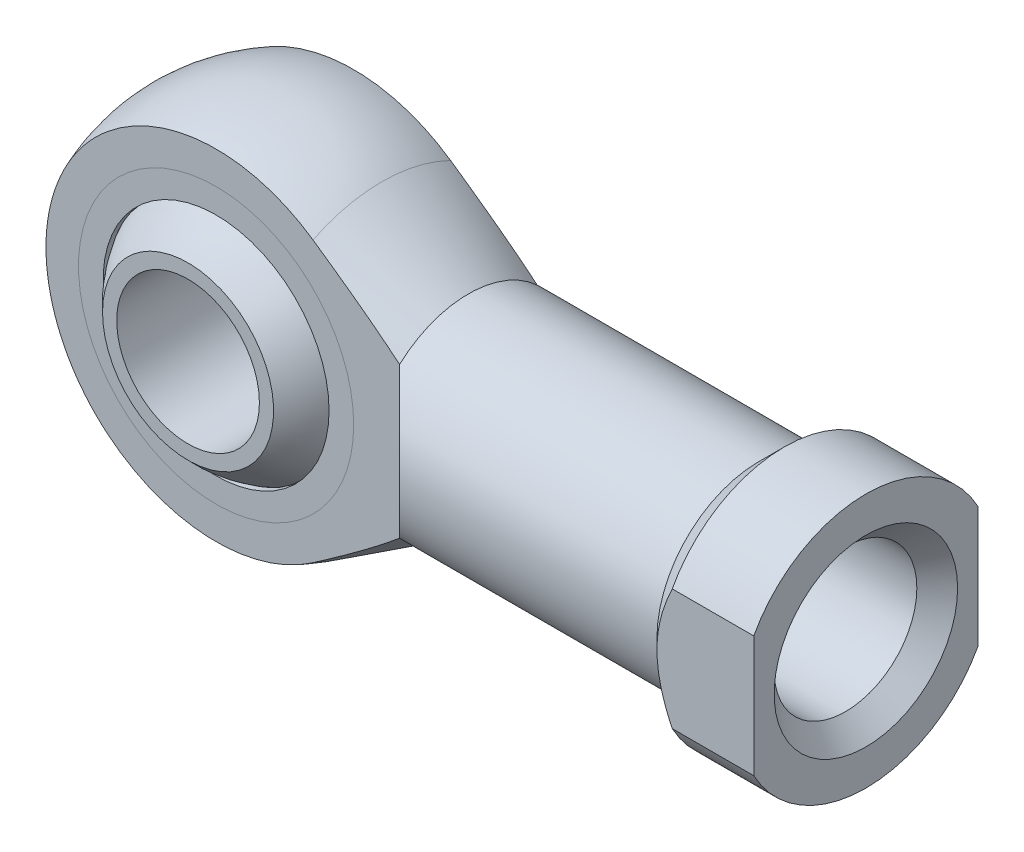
ISO-10303-21;
HEADER;
FILE_DESCRIPTION(('STEP AP214'),'2;1');
FILE_NAME('part.step','',(''),(''),'','','');
FILE_SCHEMA(('AUTOMOTIVE_DESIGN { 1 0 10303 214 1 1 1 1 }'));
ENDSEC;
DATA;
#1=APPLICATION_CONTEXT('core data for automotive mechanical design processes');
#2=APPLICATION_PROTOCOL_DEFINITION('international standard','automotive_design',2000,#1);
#3=PRODUCT_CONTEXT('',#1,'mechanical');
#4=PRODUCT('Part','Part','',(#3));
#5=PRODUCT_RELATED_PRODUCT_CATEGORY('part','',(#4));
#6=PRODUCT_DEFINITION_FORMATION('','',#4);
#7=PRODUCT_DEFINITION_CONTEXT('part definition',#1,'design');
#8=PRODUCT_DEFINITION('design','',#6,#7);
#9=PRODUCT_DEFINITION_SHAPE('','',#8);
#10=(LENGTH_UNIT() NAMED_UNIT(*) SI_UNIT(.MILLI.,.METRE.));
#11=(NAMED_UNIT(*) PLANE_ANGLE_UNIT() SI_UNIT($,.RADIAN.));
#12=(NAMED_UNIT(*) SI_UNIT($,.STERADIAN.) SOLID_ANGLE_UNIT());
#13=UNCERTAINTY_MEASURE_WITH_UNIT(LENGTH_MEASURE(1.E-05),#10,'distance_accuracy_value','');
#14=(GEOMETRIC_REPRESENTATION_CONTEXT(3) GLOBAL_UNCERTAINTY_ASSIGNED_CONTEXT((#13)) GLOBAL_UNIT_ASSIGNED_CONTEXT((#10,
#11,#12)) REPRESENTATION_CONTEXT('',''));
#15=CARTESIAN_POINT('',(0.,0.,0.));
#16=DIRECTION('',(0.,0.,1.));
#17=DIRECTION('',(1.,0.,0.));
#18=AXIS2_PLACEMENT_3D('',#15,#16,#17);
#19=CARTESIAN_POINT('',(0.,0.,0.));
#20=DIRECTION('',(0.,1.,0.));
#21=DIRECTION('',(1.,0.,0.));
#22=AXIS2_PLACEMENT_3D('',#19,#20,#21);
#23=SPHERICAL_SURFACE('',#22,12.675);
#24=CARTESIAN_POINT('',(0.,0.,0.));
#25=DIRECTION('',(0.,0.,-1.));
#26=DIRECTION('',(-1.,0.,0.));
#27=AXIS2_PLACEMENT_3D('',#24,#25,#26);
#28=SPHERICAL_SURFACE('',#27,12.675);
#29=CARTESIAN_POINT('',(0.,0.,9.5));
#30=DIRECTION('',(0.,0.,-1.));
#31=DIRECTION('',(-1.,0.,0.));
#32=AXIS2_PLACEMENT_3D('',#29,#30,#31);
#33=CIRCLE('',#32,8.39080598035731);
#34=CARTESIAN_POINT('',(-8.39080598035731,0.,9.5));
#35=VERTEX_POINT('',#34);
#36=EDGE_CURVE('P0_E26',#35,#35,#33,.F.);
#37=ORIENTED_EDGE('',*,*,#36,.F.);
#38=EDGE_LOOP('',(#37));
#39=FACE_BOUND('',#38,.T.);
#40=CARTESIAN_POINT('',(0.,0.,-9.5));
#41=DIRECTION('',(0.,0.,1.));
#42=DIRECTION('',(1.,0.,0.));
#43=AXIS2_PLACEMENT_3D('',#40,#41,#42);
#44=CIRCLE('',#43,8.39080598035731);
#45=CARTESIAN_POINT('',(8.39080598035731,0.,-9.5));
#46=VERTEX_POINT('',#45);
#47=EDGE_CURVE('P0_E10',#46,#46,#44,.F.);
#48=ORIENTED_EDGE('',*,*,#47,.F.);
#49=EDGE_LOOP('',(#48));
#50=FACE_BOUND('',#49,.T.);
#51=ADVANCED_FACE('P0_F14',(#39,#50),#28,.T.);
#52=CARTESIAN_POINT('',(0.,0.,-12.675));
#53=DIRECTION('',(0.,0.,1.));
#54=DIRECTION('',(1.,0.,0.));
#55=AXIS2_PLACEMENT_3D('',#52,#53,#54);
#56=CYLINDRICAL_SURFACE('',#55,7.);
#57=CARTESIAN_POINT('',(0.,0.,9.5));
#58=DIRECTION('',(0.,0.,-1.));
#59=DIRECTION('',(-1.,0.,0.));
#60=AXIS2_PLACEMENT_3D('',#57,#58,#59);
#61=CIRCLE('',#60,7.);
#62=CARTESIAN_POINT('',(7.,0.,9.5));
#63=VERTEX_POINT('',#62);
#64=EDGE_CURVE('P0_E17',#63,#63,#61,.F.);
#65=CARTESIAN_POINT('',(0.,0.,-9.5));
#66=DIRECTION('',(0.,0.,1.));
#67=DIRECTION('',(1.,0.,0.));
#68=AXIS2_PLACEMENT_3D('',#65,#66,#67);
#69=CIRCLE('',#68,7.);
#70=CARTESIAN_POINT('',(7.,0.,-9.5));
#71=VERTEX_POINT('',#70);
#72=EDGE_CURVE('P0_E21',#71,#71,#69,.F.);
#73=CARTESIAN_POINT('',(7.,0.,9.5));
#74=CARTESIAN_POINT('',(7.,0.,9.30208333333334));
#75=CARTESIAN_POINT('',(7.,0.,9.10416666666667));
#76=CARTESIAN_POINT('',(7.,0.,8.70833333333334));
#77=CARTESIAN_POINT('',(7.,0.,8.51041666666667));
#78=CARTESIAN_POINT('',(7.,0.,8.11458333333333));
#79=CARTESIAN_POINT('',(7.,0.,7.91666666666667));
#80=CARTESIAN_POINT('',(7.,0.,7.52083333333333));
#81=CARTESIAN_POINT('',(7.,0.,7.32291666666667));
#82=CARTESIAN_POINT('',(7.,0.,6.92708333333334));
#83=CARTESIAN_POINT('',(7.,0.,6.72916666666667));
#84=CARTESIAN_POINT('',(7.,0.,6.33333333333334));
#85=CARTESIAN_POINT('',(7.,0.,6.13541666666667));
#86=CARTESIAN_POINT('',(7.,0.,5.73958333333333));
#87=CARTESIAN_POINT('',(7.,0.,5.54166666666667));
#88=CARTESIAN_POINT('',(7.,0.,5.14583333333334));
#89=CARTESIAN_POINT('',(7.,0.,4.94791666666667));
#90=CARTESIAN_POINT('',(7.,0.,4.55208333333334));
#91=CARTESIAN_POINT('',(7.,0.,4.35416666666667));
#92=CARTESIAN_POINT('',(7.,0.,3.95833333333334));
#93=CARTESIAN_POINT('',(7.,0.,3.76041666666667));
#94=CARTESIAN_POINT('',(7.,0.,3.36458333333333));
#95=CARTESIAN_POINT('',(7.,0.,3.16666666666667));
#96=CARTESIAN_POINT('',(7.,0.,2.77083333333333));
#97=CARTESIAN_POINT('',(7.,0.,2.57291666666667));
#98=CARTESIAN_POINT('',(7.,0.,2.17708333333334));
#99=CARTESIAN_POINT('',(7.,0.,1.97916666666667));
#100=CARTESIAN_POINT('',(7.,0.,1.58333333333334));
#101=CARTESIAN_POINT('',(7.,0.,1.38541666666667));
#102=CARTESIAN_POINT('',(7.,0.,0.989583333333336));
#103=CARTESIAN_POINT('',(7.,0.,0.791666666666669));
#104=CARTESIAN_POINT('',(7.,0.,0.395833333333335));
#105=CARTESIAN_POINT('',(7.,0.,0.197916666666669));
#106=CARTESIAN_POINT('',(7.,0.,-0.197916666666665));
#107=CARTESIAN_POINT('',(7.,0.,-0.395833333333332));
#108=CARTESIAN_POINT('',(7.,0.,-0.791666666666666));
#109=CARTESIAN_POINT('',(7.,0.,-0.989583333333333));
#110=CARTESIAN_POINT('',(7.,0.,-1.38541666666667));
#111=CARTESIAN_POINT('',(7.,0.,-1.58333333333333));
#112=CARTESIAN_POINT('',(7.,0.,-1.97916666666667));
#113=CARTESIAN_POINT('',(7.,0.,-2.17708333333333));
#114=CARTESIAN_POINT('',(7.,0.,-2.57291666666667));
#115=CARTESIAN_POINT('',(7.,0.,-2.77083333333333));
#116=CARTESIAN_POINT('',(7.,0.,-3.16666666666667));
#117=CARTESIAN_POINT('',(7.,0.,-3.36458333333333));
#118=CARTESIAN_POINT('',(7.,0.,-3.76041666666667));
#119=CARTESIAN_POINT('',(7.,0.,-3.95833333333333));
#120=CARTESIAN_POINT('',(7.,0.,-4.35416666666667));
#121=CARTESIAN_POINT('',(7.,0.,-4.55208333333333));
#122=CARTESIAN_POINT('',(7.,0.,-4.94791666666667));
#123=CARTESIAN_POINT('',(7.,0.,-5.14583333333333));
#124=CARTESIAN_POINT('',(7.,0.,-5.54166666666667));
#125=CARTESIAN_POINT('',(7.,0.,-5.73958333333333));
#126=CARTESIAN_POINT('',(7.,0.,-6.13541666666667));
#127=CARTESIAN_POINT('',(7.,0.,-6.33333333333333));
#128=CARTESIAN_POINT('',(7.,0.,-6.72916666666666));
#129=CARTESIAN_POINT('',(7.,0.,-6.92708333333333));
#130=CARTESIAN_POINT('',(7.,0.,-7.32291666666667));
#131=CARTESIAN_POINT('',(7.,0.,-7.52083333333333));
#132=CARTESIAN_POINT('',(7.,0.,-7.91666666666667));
#133=CARTESIAN_POINT('',(7.,0.,-8.11458333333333));
#134=CARTESIAN_POINT('',(7.,0.,-8.51041666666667));
#135=CARTESIAN_POINT('',(7.,0.,-8.70833333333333));
#136=CARTESIAN_POINT('',(7.,0.,-9.10416666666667));
#137=CARTESIAN_POINT('',(7.,0.,-9.30208333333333));
#138=CARTESIAN_POINT('',(7.,0.,-9.5));
#139=B_SPLINE_CURVE_WITH_KNOTS('',3,(#73,#74,#75,#76,#77,#78,#79,#80,#81,#82,#83,#84,#85,#86,
#87,#88,#89,#90,#91,#92,#93,#94,#95,#96,#97,#98,#99,#100,#101,#102,#103,#104,#105,#106,#107,
#108,#109,#110,#111,#112,#113,#114,#115,#116,#117,#118,#119,#120,#121,#122,#123,#124,#125,#126,
#127,#128,#129,#130,#131,#132,#133,#134,#135,#136,#137,#138),.UNSPECIFIED.,.F.,.F.,(4,2,2,2,2,2,
2,2,2,2,2,2,2,2,2,2,2,2,2,2,2,2,2,2,2,2,2,2,2,2,2,2,4),(0.,0.593750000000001,1.1875,1.78125,
2.375,2.96875,3.5625,4.15625,4.75,5.34375,5.9375,6.53125,7.125,7.71875,8.3125,8.90625,9.5,
10.09375,10.6875,11.28125,11.875,12.46875,13.0625,13.65625,14.25,14.84375,15.4375,16.03125,
16.625,17.21875,17.8125,18.40625,19.),.UNSPECIFIED.);
#140=EDGE_CURVE('P0_BSEAM34',#63,#71,#139,.T.);
#141=ORIENTED_EDGE('',*,*,#64,.T.);
#142=ORIENTED_EDGE('',*,*,#72,.T.);
#143=ORIENTED_EDGE('',*,*,#140,.T.);
#144=ORIENTED_EDGE('',*,*,#140,.F.);
#145=EDGE_LOOP('',(#141,#143,#142,#144));
#146=FACE_BOUND('',#145,.T.);
#147=ADVANCED_FACE('P0_F34',(#146),#56,.F.);
#148=CARTESIAN_POINT('',(-12.675,-12.675,-9.5));
#149=DIRECTION('',(0.,0.,1.));
#150=DIRECTION('',(1.,0.,0.));
#151=AXIS2_PLACEMENT_3D('',#148,#149,#150);
#152=PLANE('',#151);
#153=ORIENTED_EDGE('',*,*,#47,.T.);
#154=EDGE_LOOP('',(#153));
#155=FACE_BOUND('',#154,.T.);
#156=ORIENTED_EDGE('',*,*,#72,.F.);
#157=EDGE_LOOP('',(#156));
#158=FACE_BOUND('',#157,.T.);
#159=ADVANCED_FACE('P0_F39',(#155,#158),#152,.F.);
#160=CARTESIAN_POINT('',(-12.675,-12.675,9.5));
#161=DIRECTION('',(0.,0.,-1.));
#162=DIRECTION('',(-1.,0.,0.));
#163=AXIS2_PLACEMENT_3D('',#160,#161,#162);
#164=PLANE('',#163);
#165=ORIENTED_EDGE('',*,*,#36,.T.);
#166=EDGE_LOOP('',(#165));
#167=FACE_BOUND('',#166,.T.);
#168=ORIENTED_EDGE('',*,*,#64,.F.);
#169=EDGE_LOOP('',(#168));
#170=FACE_BOUND('',#169,.T.);
#171=ADVANCED_FACE('P0_F37',(#167,#170),#164,.F.);
#172=CLOSED_SHELL('',(#51,#147,#159,#171));
#173=MANIFOLD_SOLID_BREP('P0_B1',#172);
#174=CARTESIAN_POINT('',(0.,0.,6.75));
#175=DIRECTION('',(0.,0.,1.));
#176=DIRECTION('',(1.,0.,0.));
#177=AXIS2_PLACEMENT_3D('',#174,#175,#176);
#178=PLANE('',#177);
#179=CARTESIAN_POINT('',(0.,0.,6.75));
#180=DIRECTION('',(0.,0.,1.));
#181=DIRECTION('',(1.,0.,0.));
#182=AXIS2_PLACEMENT_3D('',#179,#180,#181);
#183=CIRCLE('',#182,13.5);
#184=CARTESIAN_POINT('',(13.5,0.,6.75));
#185=VERTEX_POINT('',#184);
#186=EDGE_CURVE('P1_E10',#185,#185,#183,.T.);
#187=ORIENTED_EDGE('',*,*,#186,.T.);
#188=EDGE_LOOP('',(#187));
#189=FACE_BOUND('',#188,.T.);
#190=CARTESIAN_POINT('',(0.,0.,6.75));
#191=DIRECTION('',(0.,0.,1.));
#192=DIRECTION('',(1.,0.,0.));
#193=AXIS2_PLACEMENT_3D('',#190,#191,#192);
#194=CIRCLE('',#193,11.085);
#195=CARTESIAN_POINT('',(11.085,0.,6.75));
#196=VERTEX_POINT('',#195);
#197=EDGE_CURVE('P1_E25',#196,#196,#194,.T.);
#198=ORIENTED_EDGE('',*,*,#197,.F.);
#199=EDGE_LOOP('',(#198));
#200=FACE_BOUND('',#199,.T.);
#201=ADVANCED_FACE('P1_F14',(#189,#200),#178,.T.);
#202=CARTESIAN_POINT('',(0.,0.,6.15));
#203=DIRECTION('',(0.,0.,1.));
#204=DIRECTION('',(1.,0.,0.));
#205=AXIS2_PLACEMENT_3D('',#202,#203,#204);
#206=PLANE('',#205);
#207=CARTESIAN_POINT('',(0.,0.,6.15));
#208=DIRECTION('',(0.,0.,1.));
#209=DIRECTION('',(1.,0.,0.));
#210=AXIS2_PLACEMENT_3D('',#207,#208,#209);
#211=CIRCLE('',#210,13.5);
#212=CARTESIAN_POINT('',(13.5,0.,6.15));
#213=VERTEX_POINT('',#212);
#214=EDGE_CURVE('P1_E18',#213,#213,#211,.T.);
#215=ORIENTED_EDGE('',*,*,#214,.F.);
#216=EDGE_LOOP('',(#215));
#217=FACE_BOUND('',#216,.T.);
#218=CARTESIAN_POINT('',(0.,0.,6.15));
#219=DIRECTION('',(0.,0.,1.));
#220=DIRECTION('',(1.,0.,0.));
#221=AXIS2_PLACEMENT_3D('',#218,#219,#220);
#222=CIRCLE('',#221,11.085);
#223=CARTESIAN_POINT('',(11.085,0.,6.15));
#224=VERTEX_POINT('',#223);
#225=EDGE_CURVE('P1_E27',#224,#224,#222,.T.);
#226=ORIENTED_EDGE('',*,*,#225,.T.);
#227=EDGE_LOOP('',(#226));
#228=FACE_BOUND('',#227,.T.);
#229=ADVANCED_FACE('P1_F37',(#217,#228),#206,.F.);
#230=CARTESIAN_POINT('',(0.,0.,6.75));
#231=DIRECTION('',(0.,0.,-1.));
#232=DIRECTION('',(-1.,0.,0.));
#233=AXIS2_PLACEMENT_3D('',#230,#231,#232);
#234=CYLINDRICAL_SURFACE('',#233,13.5);
#235=ORIENTED_EDGE('',*,*,#186,.F.);
#236=EDGE_LOOP('',(#235));
#237=FACE_BOUND('',#236,.T.);
#238=ORIENTED_EDGE('',*,*,#214,.T.);
#239=EDGE_LOOP('',(#238));
#240=FACE_BOUND('',#239,.T.);
#241=ADVANCED_FACE('P1_F16',(#237,#240),#234,.T.);
#242=CARTESIAN_POINT('',(0.,0.,6.75));
#243=DIRECTION('',(0.,0.,-1.));
#244=DIRECTION('',(-1.,0.,0.));
#245=AXIS2_PLACEMENT_3D('',#242,#243,#244);
#246=CYLINDRICAL_SURFACE('',#245,11.085);
#247=ORIENTED_EDGE('',*,*,#197,.T.);
#248=EDGE_LOOP('',(#247));
#249=FACE_BOUND('',#248,.T.);
#250=ORIENTED_EDGE('',*,*,#225,.F.);
#251=EDGE_LOOP('',(#250));
#252=FACE_BOUND('',#251,.T.);
#253=ADVANCED_FACE('P1_F33',(#249,#252),#246,.F.);
#254=CLOSED_SHELL('',(#201,#229,#241,#253));
#255=MANIFOLD_SOLID_BREP('P1_B1',#254);
#256=CARTESIAN_POINT('',(0.,0.,-6.15));
#257=DIRECTION('',(0.,0.,1.));
#258=DIRECTION('',(1.,0.,0.));
#259=AXIS2_PLACEMENT_3D('',#256,#257,#258);
#260=PLANE('',#259);
#261=CARTESIAN_POINT('',(0.,0.,-6.15));
#262=DIRECTION('',(0.,0.,1.));
#263=DIRECTION('',(1.,0.,0.));
#264=AXIS2_PLACEMENT_3D('',#261,#262,#263);
#265=CIRCLE('',#264,13.5);
#266=CARTESIAN_POINT('',(13.5,0.,-6.15));
#267=VERTEX_POINT('',#266);
#268=EDGE_CURVE('P2_E10',#267,#267,#265,.T.);
#269=ORIENTED_EDGE('',*,*,#268,.T.);
#270=EDGE_LOOP('',(#269));
#271=FACE_BOUND('',#270,.T.);
#272=CARTESIAN_POINT('',(0.,0.,-6.15));
#273=DIRECTION('',(0.,0.,1.));
#274=DIRECTION('',(1.,0.,0.));
#275=AXIS2_PLACEMENT_3D('',#272,#273,#274);
#276=CIRCLE('',#275,11.085);
#277=CARTESIAN_POINT('',(11.085,0.,-6.15));
#278=VERTEX_POINT('',#277);
#279=EDGE_CURVE('P2_E25',#278,#278,#276,.T.);
#280=ORIENTED_EDGE('',*,*,#279,.F.);
#281=EDGE_LOOP('',(#280));
#282=FACE_BOUND('',#281,.T.);
#283=ADVANCED_FACE('P2_F14',(#271,#282),#260,.T.);
#284=CARTESIAN_POINT('',(0.,0.,-6.75));
#285=DIRECTION('',(0.,0.,1.));
#286=DIRECTION('',(1.,0.,0.));
#287=AXIS2_PLACEMENT_3D('',#284,#285,#286);
#288=PLANE('',#287);
#289=CARTESIAN_POINT('',(0.,0.,-6.75));
#290=DIRECTION('',(0.,0.,1.));
#291=DIRECTION('',(1.,0.,0.));
#292=AXIS2_PLACEMENT_3D('',#289,#290,#291);
#293=CIRCLE('',#292,13.5);
#294=CARTESIAN_POINT('',(13.5,0.,-6.75));
#295=VERTEX_POINT('',#294);
#296=EDGE_CURVE('P2_E18',#295,#295,#293,.T.);
#297=ORIENTED_EDGE('',*,*,#296,.F.);
#298=EDGE_LOOP('',(#297));
#299=FACE_BOUND('',#298,.T.);
#300=CARTESIAN_POINT('',(0.,0.,-6.75));
#301=DIRECTION('',(0.,0.,1.));
#302=DIRECTION('',(1.,0.,0.));
#303=AXIS2_PLACEMENT_3D('',#300,#301,#302);
#304=CIRCLE('',#303,11.085);
#305=CARTESIAN_POINT('',(11.085,0.,-6.75));
#306=VERTEX_POINT('',#305);
#307=EDGE_CURVE('P2_E27',#306,#306,#304,.T.);
#308=ORIENTED_EDGE('',*,*,#307,.T.);
#309=EDGE_LOOP('',(#308));
#310=FACE_BOUND('',#309,.T.);
#311=ADVANCED_FACE('P2_F37',(#299,#310),#288,.F.);
#312=CARTESIAN_POINT('',(0.,0.,-6.15));
#313=DIRECTION('',(0.,0.,-1.));
#314=DIRECTION('',(-1.,0.,0.));
#315=AXIS2_PLACEMENT_3D('',#312,#313,#314);
#316=CYLINDRICAL_SURFACE('',#315,13.5);
#317=ORIENTED_EDGE('',*,*,#268,.F.);
#318=EDGE_LOOP('',(#317));
#319=FACE_BOUND('',#318,.T.);
#320=ORIENTED_EDGE('',*,*,#296,.T.);
#321=EDGE_LOOP('',(#320));
#322=FACE_BOUND('',#321,.T.);
#323=ADVANCED_FACE('P2_F16',(#319,#322),#316,.T.);
#324=CARTESIAN_POINT('',(0.,0.,-6.15));
#325=DIRECTION('',(0.,0.,-1.));
#326=DIRECTION('',(-1.,0.,0.));
#327=AXIS2_PLACEMENT_3D('',#324,#325,#326);
#328=CYLINDRICAL_SURFACE('',#327,11.085);
#329=ORIENTED_EDGE('',*,*,#279,.T.);
#330=EDGE_LOOP('',(#329));
#331=FACE_BOUND('',#330,.T.);
#332=ORIENTED_EDGE('',*,*,#307,.F.);
#333=EDGE_LOOP('',(#332));
#334=FACE_BOUND('',#333,.T.);
#335=ADVANCED_FACE('P2_F33',(#331,#334),#328,.F.);
#336=CLOSED_SHELL('',(#283,#311,#323,#335));
#337=MANIFOLD_SOLID_BREP('P2_B1',#336);
#338=CARTESIAN_POINT('',(0.,0.,0.));
#339=DIRECTION('',(0.,1.,0.));
#340=DIRECTION('',(1.,0.,0.));
#341=AXIS2_PLACEMENT_3D('',#338,#339,#340);
#342=SPHERICAL_SURFACE('',#341,12.675);
#343=CARTESIAN_POINT('',(0.,0.,0.));
#344=DIRECTION('',(0.,0.,1.));
#345=DIRECTION('',(1.,0.,0.));
#346=AXIS2_PLACEMENT_3D('',#343,#344,#345);
#347=SPHERICAL_SURFACE('',#346,12.675);
#348=CARTESIAN_POINT('',(0.,0.,6.15));
#349=DIRECTION('',(0.,0.,1.));
#350=DIRECTION('',(1.,0.,0.));
#351=AXIS2_PLACEMENT_3D('',#348,#349,#350);
#352=CIRCLE('',#351,11.0830106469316);
#353=CARTESIAN_POINT('',(11.0830106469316,0.,6.15));
#354=VERTEX_POINT('',#353);
#355=EDGE_CURVE('P3_E73',#354,#354,#352,.F.);
#356=ORIENTED_EDGE('',*,*,#355,.F.);
#357=EDGE_LOOP('',(#356));
#358=FACE_BOUND('',#357,.T.);
#359=CARTESIAN_POINT('',(0.,0.,-6.15));
#360=DIRECTION('',(0.,0.,-1.));
#361=DIRECTION('',(-1.,0.,0.));
#362=AXIS2_PLACEMENT_3D('',#359,#360,#361);
#363=CIRCLE('',#362,11.0830106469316);
#364=CARTESIAN_POINT('',(-11.0830106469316,0.,-6.15));
#365=VERTEX_POINT('',#364);
#366=EDGE_CURVE('P3_E20',#365,#365,#363,.F.);
#367=ORIENTED_EDGE('',*,*,#366,.F.);
#368=EDGE_LOOP('',(#367));
#369=FACE_BOUND('',#368,.T.);
#370=ADVANCED_FACE('P3_F16',(#358,#369),#347,.F.);
#371=CARTESIAN_POINT('',(-18.,-18.,-6.75));
#372=DIRECTION('',(0.,0.,1.));
#373=DIRECTION('',(1.,0.,0.));
#374=AXIS2_PLACEMENT_3D('',#371,#372,#373);
#375=PLANE('',#374);
#376=CARTESIAN_POINT('',(0.,0.,-6.75));
#377=DIRECTION('',(0.,0.,1.));
#378=DIRECTION('',(1.,0.,0.));
#379=AXIS2_PLACEMENT_3D('',#376,#377,#378);
#380=CIRCLE('',#379,16.6864465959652);
#381=CARTESIAN_POINT('',(9.50943396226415,13.7116069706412,-6.75));
#382=VERTEX_POINT('',#381);
#383=CARTESIAN_POINT('',(9.50943396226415,-13.7116069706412,-6.75));
#384=VERTEX_POINT('',#383);
#385=EDGE_CURVE('P3_E11',#382,#384,#380,.T.);
#386=ORIENTED_EDGE('',*,*,#385,.F.);
#387=CARTESIAN_POINT('',(-12.4700796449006,-28.1615071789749,-6.75));
#388=CARTESIAN_POINT('',(-11.8248152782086,-27.7486338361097,-6.75));
#389=CARTESIAN_POINT('',(-11.1797715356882,-27.3354155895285,-6.75));
#390=CARTESIAN_POINT('',(-9.89019686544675,-26.5081781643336,-6.75));
#391=CARTESIAN_POINT('',(-9.24566593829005,-26.0941589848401,-6.75));
#392=CARTESIAN_POINT('',(-7.31267551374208,-24.8505569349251,-6.75));
#393=CARTESIAN_POINT('',(-6.02509521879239,-24.0196065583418,-6.75));
#394=CARTESIAN_POINT('',(-3.44476052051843,-22.3474240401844,-6.75));
#395=CARTESIAN_POINT('',(-2.15202665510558,-21.506160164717,-6.75));
#396=CARTESIAN_POINT('',(-0.216454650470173,-20.2391509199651,-6.75));
#397=CARTESIAN_POINT('',(0.428084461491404,-19.8160042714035,-6.75));
#398=CARTESIAN_POINT('',(1.71578396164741,-18.9676189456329,-6.75));
#399=CARTESIAN_POINT('',(2.35894435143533,-18.5423802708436,-6.75));
#400=CARTESIAN_POINT('',(3.67901471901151,-17.6658398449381,-6.75));
#401=CARTESIAN_POINT('',(4.35582931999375,-17.2143943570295,-6.75));
#402=CARTESIAN_POINT('',(5.70709822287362,-16.3079871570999,-6.75));
#403=CARTESIAN_POINT('',(6.38155253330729,-15.8530254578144,-6.75));
#404=CARTESIAN_POINT('',(7.72786193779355,-14.9383496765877,-6.75));
#405=CARTESIAN_POINT('',(8.39971510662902,-14.4786327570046,-6.75));
#406=CARTESIAN_POINT('',(9.73939721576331,-13.5534243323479,-6.75));
#407=CARTESIAN_POINT('',(10.407226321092,-13.0879330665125,-6.75));
#408=CARTESIAN_POINT('',(11.7351348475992,-12.1509113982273,-6.75));
#409=CARTESIAN_POINT('',(12.3952332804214,-11.6794080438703,-6.75));
#410=CARTESIAN_POINT('',(13.3797134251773,-10.9642207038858,-6.75));
#411=CARTESIAN_POINT('',(13.7069594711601,-10.7244798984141,-6.75));
#412=CARTESIAN_POINT('',(14.3591220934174,-10.241850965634,-6.75));
#413=CARTESIAN_POINT('',(14.6840386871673,-9.99896286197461,-6.75));
#414=CARTESIAN_POINT('',(15.3306757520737,-9.50966617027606,-6.75));
#415=CARTESIAN_POINT('',(15.6523992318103,-9.26326156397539,-6.75));
#416=CARTESIAN_POINT('',(16.2922806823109,-8.76586780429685,-6.75));
#417=CARTESIAN_POINT('',(16.6104387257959,-8.5148787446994,-6.75));
#418=CARTESIAN_POINT('',(17.242116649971,-8.00731567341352,-6.75));
#419=CARTESIAN_POINT('',(17.5556379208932,-7.75074339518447,-6.75));
#420=CARTESIAN_POINT('',(18.1767435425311,-7.2305267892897,-6.75));
#421=CARTESIAN_POINT('',(18.4843284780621,-6.96688316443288,-6.75));
#422=CARTESIAN_POINT('',(18.8950591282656,-6.6040615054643,-6.75));
#423=CARTESIAN_POINT('',(19.0017109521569,-6.50884535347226,-6.75));
#424=CARTESIAN_POINT('',(19.2138965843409,-6.31716450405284,-6.75));
#425=CARTESIAN_POINT('',(19.3194303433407,-6.22069975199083,-6.75));
#426=CARTESIAN_POINT('',(19.5292505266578,-6.0263937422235,-6.75));
#427=CARTESIAN_POINT('',(19.6335367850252,-5.92855230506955,-6.75));
#428=CARTESIAN_POINT('',(19.8406777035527,-5.73136849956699,-6.75));
#429=CARTESIAN_POINT('',(19.943532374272,-5.63202614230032,-6.75));
#430=CARTESIAN_POINT('',(20.2500723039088,-5.33112486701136,-6.75));
#431=CARTESIAN_POINT('',(20.4513248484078,-5.12706767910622,-6.75));
#432=CARTESIAN_POINT('',(20.8452844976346,-4.71085416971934,-6.75));
#433=CARTESIAN_POINT('',(21.0379926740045,-4.49869887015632,-6.75));
#434=CARTESIAN_POINT('',(21.3801349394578,-4.1012413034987,-6.75));
#435=CARTESIAN_POINT('',(21.5313628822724,-3.9174920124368,-6.75));
#436=CARTESIAN_POINT('',(21.8234240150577,-3.54174094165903,-6.75));
#437=CARTESIAN_POINT('',(21.9642536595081,-3.34973638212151,-6.75));
#438=CARTESIAN_POINT('',(22.2315065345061,-2.95679942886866,-6.75));
#439=CARTESIAN_POINT('',(22.3579785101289,-2.75590067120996,-6.75));
#440=CARTESIAN_POINT('',(22.5921315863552,-2.34360819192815,-6.75));
#441=CARTESIAN_POINT('',(22.6998323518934,-2.13222575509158,-6.75));
#442=CARTESIAN_POINT('',(22.9031805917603,-1.66849975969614,-6.75));
#443=CARTESIAN_POINT('',(22.9952088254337,-1.41449041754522,-6.75));
#444=CARTESIAN_POINT('',(23.1007462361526,-1.02514650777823,-6.75));
#445=CARTESIAN_POINT('',(23.1304918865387,-0.894136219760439,-6.75));
#446=CARTESIAN_POINT('',(23.1781008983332,-0.630001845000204,-6.75));
#447=CARTESIAN_POINT('',(23.1959727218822,-0.496879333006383,-6.75));
#448=CARTESIAN_POINT('',(23.2127342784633,-0.302862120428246,-6.75));
#449=CARTESIAN_POINT('',(23.2166591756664,-0.242368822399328,-6.75));
#450=CARTESIAN_POINT('',(23.2219005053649,-0.121253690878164,-6.75));
#451=CARTESIAN_POINT('',(23.2232162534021,-0.0606318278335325,-6.75));
#452=CARTESIAN_POINT('',(23.2232097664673,0.139254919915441,-6.75));
#453=CARTESIAN_POINT('',(23.2162543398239,0.278562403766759,-6.75));
#454=CARTESIAN_POINT('',(23.1887668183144,0.555888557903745,-6.75));
#455=CARTESIAN_POINT('',(23.1682246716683,0.6939061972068,-6.75));
#456=CARTESIAN_POINT('',(23.1144707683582,0.967748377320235,-6.75));
#457=CARTESIAN_POINT('',(23.0812309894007,1.10356736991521,-6.75));
#458=CARTESIAN_POINT('',(23.0034414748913,1.37194658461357,-6.75));
#459=CARTESIAN_POINT('',(22.9588865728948,1.50450528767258,-6.75));
#460=CARTESIAN_POINT('',(22.8377055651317,1.82476184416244,-6.75));
#461=CARTESIAN_POINT('',(22.7556718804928,2.01041244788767,-6.75));
#462=CARTESIAN_POINT('',(22.5753801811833,2.37364710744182,-6.75));
#463=CARTESIAN_POINT('',(22.4771110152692,2.5512255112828,-6.75));
#464=CARTESIAN_POINT('',(22.2676254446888,2.8994212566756,-6.75));
#465=CARTESIAN_POINT('',(22.1563616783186,3.07000986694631,-6.75));
#466=CARTESIAN_POINT('',(21.9821443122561,3.32068846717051,-6.75));
#467=CARTESIAN_POINT('',(21.9228593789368,3.40337068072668,-6.75));
#468=CARTESIAN_POINT('',(21.8021122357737,3.56713249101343,-6.75));
#469=CARTESIAN_POINT('',(21.7406500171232,3.64821208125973,-6.75));
#470=CARTESIAN_POINT('',(21.5700628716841,3.8677397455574,-6.75));
#471=CARTESIAN_POINT('',(21.4590122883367,4.00469293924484,-6.75));
#472=CARTESIAN_POINT('',(21.232190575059,4.27464403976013,-6.75));
#473=CARTESIAN_POINT('',(21.1164186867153,4.40764130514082,-6.75));
#474=CARTESIAN_POINT('',(20.763177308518,4.80156424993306,-6.75));
#475=CARTESIAN_POINT('',(20.5198944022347,5.05727994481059,-6.75));
#476=CARTESIAN_POINT('',(20.0219620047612,5.55849909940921,-6.75));
#477=CARTESIAN_POINT('',(19.7672860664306,5.80397593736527,-6.75));
#478=CARTESIAN_POINT('',(19.250093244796,6.28633896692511,-6.75));
#479=CARTESIAN_POINT('',(18.9875786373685,6.52322760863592,-6.75));
#480=CARTESIAN_POINT('',(18.4539513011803,6.9925574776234,-6.75));
#481=CARTESIAN_POINT('',(18.1827787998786,7.22493042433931,-6.75));
#482=CARTESIAN_POINT('',(17.6357456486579,7.68410963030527,-6.75));
#483=CARTESIAN_POINT('',(17.3598847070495,7.91091554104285,-6.75));
#484=CARTESIAN_POINT('',(16.8049206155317,8.35960656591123,-6.75));
#485=CARTESIAN_POINT('',(16.5258232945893,8.5814989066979,-6.75));
#486=CARTESIAN_POINT('',(15.9646864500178,9.02150605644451,-6.75));
#487=CARTESIAN_POINT('',(15.6826470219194,9.23962098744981,-6.75));
#488=CARTESIAN_POINT('',(15.1107942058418,9.67679288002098,-6.75));
#489=CARTESIAN_POINT('',(14.8209347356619,9.895789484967,-6.75));
#490=CARTESIAN_POINT('',(14.2391430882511,10.3310139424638,-6.75));
#491=CARTESIAN_POINT('',(13.9472108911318,10.5472417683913,-6.75));
#492=CARTESIAN_POINT('',(13.0688061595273,11.1924249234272,-6.75));
#493=CARTESIAN_POINT('',(12.479749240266,11.6178618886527,-6.75));
#494=CARTESIAN_POINT('',(11.2965829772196,12.4618448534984,-6.75));
#495=CARTESIAN_POINT('',(10.7024727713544,12.8803896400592,-6.75));
#496=CARTESIAN_POINT('',(9.51052399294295,13.7121426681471,-6.75));
#497=CARTESIAN_POINT('',(8.91268538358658,14.1253508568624,-6.75));
#498=CARTESIAN_POINT('',(7.71332258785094,14.948149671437,-6.75));
#499=CARTESIAN_POINT('',(7.11179447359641,15.357734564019,-6.75));
#500=CARTESIAN_POINT('',(5.90647201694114,16.1735598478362,-6.75));
#501=CARTESIAN_POINT('',(5.30267766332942,16.5798002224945,-6.75));
#502=CARTESIAN_POINT('',(4.09333886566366,17.389523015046,-6.75));
#503=CARTESIAN_POINT('',(3.48779461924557,17.7930057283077,-6.75));
#504=CARTESIAN_POINT('',(2.27522292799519,18.5977362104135,-6.75));
#505=CARTESIAN_POINT('',(1.66819548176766,18.9989839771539,-6.75));
#506=CARTESIAN_POINT('',(-0.0623996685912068,20.1391314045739,-6.75));
#507=CARTESIAN_POINT('',(-1.18743990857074,20.8757957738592,-6.75));
#508=CARTESIAN_POINT('',(-3.44056461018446,22.3445287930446,-6.75));
#509=CARTESIAN_POINT('',(-4.56864917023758,23.0765972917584,-6.75));
#510=CARTESIAN_POINT('',(-6.82466997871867,24.5356760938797,-6.75));
#511=CARTESIAN_POINT('',(-7.95260140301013,25.2626938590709,-6.75));
#512=CARTESIAN_POINT('',(-9.64577808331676,26.3511791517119,-6.75));
#513=CARTESIAN_POINT('',(-10.2103723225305,26.7136601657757,-6.75));
#514=CARTESIAN_POINT('',(-11.3399475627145,27.4380184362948,-6.75));
#515=CARTESIAN_POINT('',(-11.9049285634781,27.7998956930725,-6.75));
#516=CARTESIAN_POINT('',(-12.4700796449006,28.1615071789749,-6.75));
#517=B_SPLINE_CURVE_WITH_KNOTS('',3,(#387,#388,#389,#390,#391,#392,#393,#394,#395,#396,#397,
#398,#399,#400,#401,#402,#403,#404,#405,#406,#407,#408,#409,#410,#411,#412,#413,#414,#415,#416,
#417,#418,#419,#420,#421,#422,#423,#424,#425,#426,#427,#428,#429,#430,#431,#432,#433,#434,#435,
#436,#437,#438,#439,#440,#441,#442,#443,#444,#445,#446,#447,#448,#449,#450,#451,#452,#453,#454,
#455,#456,#457,#458,#459,#460,#461,#462,#463,#464,#465,#466,#467,#468,#469,#470,#471,#472,#473,
#474,#475,#476,#477,#478,#479,#480,#481,#482,#483,#484,#485,#486,#487,#488,#489,#490,#491,#492,
#493,#494,#495,#496,#497,#498,#499,#500,#501,#502,#503,#504,#505,#506,#507,#508,#509,#510,#511,
#512,#513,#514,#515,#516),.UNSPECIFIED.,.F.,.F.,(4,2,2,2,2,2,2,2,2,2,2,2,2,2,2,2,2,2,2,2,2,2,2,
2,2,2,2,2,2,2,2,2,2,2,2,2,2,2,2,2,2,2,2,2,2,2,2,2,2,2,2,2,2,2,2,2,2,2,2,2,2,2,2,2,4),(0.,
2.29814579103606,4.59629410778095,9.19357652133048,13.8206493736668,16.1337293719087,
18.446806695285,20.8874800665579,23.3281446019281,25.770360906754,28.2124763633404,
30.6459896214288,31.8629757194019,33.0799526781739,34.2956465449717,35.5113155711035,
36.7266123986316,37.9417888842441,38.3706944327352,38.7996188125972,39.2285996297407,
39.6575772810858,40.5171976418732,41.3767098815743,42.0903577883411,42.8042479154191,
43.5156368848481,44.2262760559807,45.033355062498,45.4359464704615,45.838250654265,
46.0200647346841,46.2019265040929,46.619613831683,47.0376105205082,47.4565350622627,
47.8756512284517,48.4834788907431,49.0917257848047,49.7022631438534,50.0074561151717,
50.3126503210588,50.8414665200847,51.370368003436,52.4287110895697,53.489653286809,
54.550290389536,55.6215474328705,56.6928713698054,57.7624980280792,58.832090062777,
59.9219336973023,61.0117878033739,63.1915854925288,65.3717628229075,67.5519617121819,
69.7351482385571,71.9183455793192,74.1013052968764,76.2842670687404,80.3185410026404,
84.352946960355,88.3787405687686,90.3915572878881,92.4043729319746),.UNSPECIFIED.);
#518=CARTESIAN_POINT('',(18.,7.37817728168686,-6.75));
#519=VERTEX_POINT('',#518);
#520=EDGE_CURVE('P3_E102',#519,#382,#517,.T.);
#521=ORIENTED_EDGE('',*,*,#520,.F.);
#522=DIRECTION('',(0.,1.,0.));
#523=VECTOR('',#522,1.);
#524=CARTESIAN_POINT('',(18.,-18.,-6.75));
#525=LINE('',#524,#523);
#526=CARTESIAN_POINT('',(18.,-7.37817728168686,-6.75));
#527=VERTEX_POINT('',#526);
#528=EDGE_CURVE('P3_E64',#527,#519,#525,.T.);
#529=ORIENTED_EDGE('',*,*,#528,.F.);
#530=EDGE_CURVE('P3_E33',#384,#527,#517,.T.);
#531=ORIENTED_EDGE('',*,*,#530,.F.);
#532=EDGE_LOOP('',(#386,#521,#529,#531));
#533=FACE_BOUND('',#532,.T.);
#534=CARTESIAN_POINT('',(0.,0.,-6.75));
#535=DIRECTION('',(0.,0.,1.));
#536=DIRECTION('',(1.,0.,0.));
#537=AXIS2_PLACEMENT_3D('',#534,#535,#536);
#538=CIRCLE('',#537,13.5);
#539=CARTESIAN_POINT('',(13.5,0.,-6.75));
#540=VERTEX_POINT('',#539);
#541=EDGE_CURVE('P3_E95',#540,#540,#538,.T.);
#542=ORIENTED_EDGE('',*,*,#541,.T.);
#543=EDGE_LOOP('',(#542));
#544=FACE_BOUND('',#543,.T.);
#545=ADVANCED_FACE('P3_F115',(#533,#544),#375,.F.);
#546=CARTESIAN_POINT('',(18.,0.,0.));
#547=DIRECTION('',(-1.,0.,0.));
#548=DIRECTION('',(0.,0.,1.));
#549=AXIS2_PLACEMENT_3D('',#546,#547,#548);
#550=CONICAL_SURFACE('',#549,10.,0.556599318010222);
#551=CARTESIAN_POINT('',(9.50943396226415,0.,0.));
#552=DIRECTION('',(-1.,0.,0.));
#553=DIRECTION('',(0.,0.,1.));
#554=AXIS2_PLACEMENT_3D('',#551,#552,#553);
#555=CIRCLE('',#554,15.2830188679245);
#556=CARTESIAN_POINT('',(9.50943396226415,-13.7116069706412,6.75));
#557=VERTEX_POINT('',#556);
#558=EDGE_CURVE('P3_E79',#384,#557,#555,.T.);
#559=ORIENTED_EDGE('',*,*,#558,.F.);
#560=ORIENTED_EDGE('',*,*,#530,.T.);
#561=CARTESIAN_POINT('',(18.,0.,0.));
#562=DIRECTION('',(-1.,0.,0.));
#563=DIRECTION('',(0.,0.,1.));
#564=AXIS2_PLACEMENT_3D('',#561,#562,#563);
#565=CIRCLE('',#564,10.);
#566=CARTESIAN_POINT('',(18.,-7.37817728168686,6.75));
#567=VERTEX_POINT('',#566);
#568=EDGE_CURVE('P3_E70',#527,#567,#565,.T.);
#569=ORIENTED_EDGE('',*,*,#568,.T.);
#570=CARTESIAN_POINT('',(-12.4700796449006,28.1615071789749,6.75));
#571=CARTESIAN_POINT('',(-11.8248152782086,27.7486338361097,6.75));
#572=CARTESIAN_POINT('',(-11.1797715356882,27.3354155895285,6.75));
#573=CARTESIAN_POINT('',(-9.89019686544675,26.5081781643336,6.75));
#574=CARTESIAN_POINT('',(-9.24566593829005,26.0941589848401,6.75));
#575=CARTESIAN_POINT('',(-7.31267551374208,24.8505569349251,6.75));
#576=CARTESIAN_POINT('',(-6.02509521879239,24.0196065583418,6.75));
#577=CARTESIAN_POINT('',(-3.44476052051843,22.3474240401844,6.75));
#578=CARTESIAN_POINT('',(-2.15202665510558,21.506160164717,6.75));
#579=CARTESIAN_POINT('',(-0.216454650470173,20.2391509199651,6.75));
#580=CARTESIAN_POINT('',(0.428084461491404,19.8160042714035,6.75));
#581=CARTESIAN_POINT('',(1.71578396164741,18.9676189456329,6.75));
#582=CARTESIAN_POINT('',(2.35894435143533,18.5423802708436,6.75));
#583=CARTESIAN_POINT('',(3.67901471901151,17.6658398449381,6.75));
#584=CARTESIAN_POINT('',(4.35582931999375,17.2143943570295,6.75));
#585=CARTESIAN_POINT('',(5.70709822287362,16.3079871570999,6.75));
#586=CARTESIAN_POINT('',(6.38155253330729,15.8530254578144,6.75));
#587=CARTESIAN_POINT('',(7.72786193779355,14.9383496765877,6.75));
#588=CARTESIAN_POINT('',(8.39971510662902,14.4786327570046,6.75));
#589=CARTESIAN_POINT('',(9.73939721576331,13.5534243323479,6.75));
#590=CARTESIAN_POINT('',(10.407226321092,13.0879330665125,6.75));
#591=CARTESIAN_POINT('',(11.7351348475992,12.1509113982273,6.75));
#592=CARTESIAN_POINT('',(12.3952332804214,11.6794080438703,6.75));
#593=CARTESIAN_POINT('',(13.3797134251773,10.9642207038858,6.75));
#594=CARTESIAN_POINT('',(13.7069594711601,10.7244798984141,6.75));
#595=CARTESIAN_POINT('',(14.3591220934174,10.241850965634,6.75));
#596=CARTESIAN_POINT('',(14.6840386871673,9.99896286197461,6.75));
#597=CARTESIAN_POINT('',(15.3306757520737,9.50966617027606,6.75));
#598=CARTESIAN_POINT('',(15.6523992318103,9.26326156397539,6.75));
#599=CARTESIAN_POINT('',(16.2922806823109,8.76586780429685,6.75));
#600=CARTESIAN_POINT('',(16.6104387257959,8.5148787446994,6.75));
#601=CARTESIAN_POINT('',(17.242116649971,8.00731567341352,6.75));
#602=CARTESIAN_POINT('',(17.5556379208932,7.75074339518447,6.75));
#603=CARTESIAN_POINT('',(18.1767435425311,7.2305267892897,6.75));
#604=CARTESIAN_POINT('',(18.4843284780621,6.96688316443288,6.75));
#605=CARTESIAN_POINT('',(18.8950591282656,6.6040615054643,6.75));
#606=CARTESIAN_POINT('',(19.0017109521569,6.50884535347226,6.75));
#607=CARTESIAN_POINT('',(19.2138965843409,6.31716450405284,6.75));
#608=CARTESIAN_POINT('',(19.3194303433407,6.22069975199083,6.75));
#609=CARTESIAN_POINT('',(19.5292505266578,6.0263937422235,6.75));
#610=CARTESIAN_POINT('',(19.6335367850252,5.92855230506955,6.75));
#611=CARTESIAN_POINT('',(19.8406777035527,5.73136849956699,6.75));
#612=CARTESIAN_POINT('',(19.943532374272,5.63202614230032,6.75));
#613=CARTESIAN_POINT('',(20.2500723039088,5.33112486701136,6.75));
#614=CARTESIAN_POINT('',(20.4513248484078,5.12706767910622,6.75));
#615=CARTESIAN_POINT('',(20.8452844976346,4.71085416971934,6.75));
#616=CARTESIAN_POINT('',(21.0379926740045,4.49869887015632,6.75));
#617=CARTESIAN_POINT('',(21.3801349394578,4.1012413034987,6.75));
#618=CARTESIAN_POINT('',(21.5313628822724,3.9174920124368,6.75));
#619=CARTESIAN_POINT('',(21.8234240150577,3.54174094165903,6.75));
#620=CARTESIAN_POINT('',(21.9642536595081,3.34973638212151,6.75));
#621=CARTESIAN_POINT('',(22.2315065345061,2.95679942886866,6.75));
#622=CARTESIAN_POINT('',(22.3579785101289,2.75590067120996,6.75));
#623=CARTESIAN_POINT('',(22.5921315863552,2.34360819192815,6.75));
#624=CARTESIAN_POINT('',(22.6998323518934,2.13222575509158,6.75));
#625=CARTESIAN_POINT('',(22.9031805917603,1.66849975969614,6.75));
#626=CARTESIAN_POINT('',(22.9952088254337,1.41449041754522,6.75));
#627=CARTESIAN_POINT('',(23.1007462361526,1.02514650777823,6.75));
#628=CARTESIAN_POINT('',(23.1304918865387,0.894136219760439,6.75));
#629=CARTESIAN_POINT('',(23.1781008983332,0.630001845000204,6.75));
#630=CARTESIAN_POINT('',(23.1959727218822,0.496879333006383,6.75));
#631=CARTESIAN_POINT('',(23.2127342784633,0.302862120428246,6.75));
#632=CARTESIAN_POINT('',(23.2166591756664,0.242368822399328,6.75));
#633=CARTESIAN_POINT('',(23.2219005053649,0.121253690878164,6.75));
#634=CARTESIAN_POINT('',(23.2232162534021,0.0606318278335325,6.75));
#635=CARTESIAN_POINT('',(23.2232097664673,-0.139254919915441,6.75));
#636=CARTESIAN_POINT('',(23.2162543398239,-0.278562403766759,6.75));
#637=CARTESIAN_POINT('',(23.1887668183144,-0.555888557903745,6.75));
#638=CARTESIAN_POINT('',(23.1682246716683,-0.6939061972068,6.75));
#639=CARTESIAN_POINT('',(23.1144707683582,-0.967748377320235,6.75));
#640=CARTESIAN_POINT('',(23.0812309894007,-1.10356736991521,6.75));
#641=CARTESIAN_POINT('',(23.0034414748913,-1.37194658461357,6.75));
#642=CARTESIAN_POINT('',(22.9588865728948,-1.50450528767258,6.75));
#643=CARTESIAN_POINT('',(22.8377055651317,-1.82476184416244,6.75));
#644=CARTESIAN_POINT('',(22.7556718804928,-2.01041244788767,6.75));
#645=CARTESIAN_POINT('',(22.5753801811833,-2.37364710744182,6.75));
#646=CARTESIAN_POINT('',(22.4771110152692,-2.5512255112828,6.75));
#647=CARTESIAN_POINT('',(22.2676254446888,-2.8994212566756,6.75));
#648=CARTESIAN_POINT('',(22.1563616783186,-3.07000986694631,6.75));
#649=CARTESIAN_POINT('',(21.9821443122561,-3.32068846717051,6.75));
#650=CARTESIAN_POINT('',(21.9228593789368,-3.40337068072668,6.75));
#651=CARTESIAN_POINT('',(21.8021122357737,-3.56713249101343,6.75));
#652=CARTESIAN_POINT('',(21.7406500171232,-3.64821208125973,6.75));
#653=CARTESIAN_POINT('',(21.5700628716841,-3.8677397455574,6.75));
#654=CARTESIAN_POINT('',(21.4590122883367,-4.00469293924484,6.75));
#655=CARTESIAN_POINT('',(21.232190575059,-4.27464403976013,6.75));
#656=CARTESIAN_POINT('',(21.1164186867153,-4.40764130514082,6.75));
#657=CARTESIAN_POINT('',(20.763177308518,-4.80156424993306,6.75));
#658=CARTESIAN_POINT('',(20.5198944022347,-5.05727994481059,6.75));
#659=CARTESIAN_POINT('',(20.0219620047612,-5.55849909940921,6.75));
#660=CARTESIAN_POINT('',(19.7672860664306,-5.80397593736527,6.75));
#661=CARTESIAN_POINT('',(19.250093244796,-6.28633896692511,6.75));
#662=CARTESIAN_POINT('',(18.9875786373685,-6.52322760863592,6.75));
#663=CARTESIAN_POINT('',(18.4539513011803,-6.9925574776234,6.75));
#664=CARTESIAN_POINT('',(18.1827787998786,-7.22493042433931,6.75));
#665=CARTESIAN_POINT('',(17.6357456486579,-7.68410963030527,6.75));
#666=CARTESIAN_POINT('',(17.3598847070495,-7.91091554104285,6.75));
#667=CARTESIAN_POINT('',(16.8049206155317,-8.35960656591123,6.75));
#668=CARTESIAN_POINT('',(16.5258232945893,-8.5814989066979,6.75));
#669=CARTESIAN_POINT('',(15.9646864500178,-9.02150605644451,6.75));
#670=CARTESIAN_POINT('',(15.6826470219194,-9.23962098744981,6.75));
#671=CARTESIAN_POINT('',(15.1107942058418,-9.67679288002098,6.75));
#672=CARTESIAN_POINT('',(14.8209347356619,-9.895789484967,6.75));
#673=CARTESIAN_POINT('',(14.2391430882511,-10.3310139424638,6.75));
#674=CARTESIAN_POINT('',(13.9472108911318,-10.5472417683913,6.75));
#675=CARTESIAN_POINT('',(13.0688061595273,-11.1924249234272,6.75));
#676=CARTESIAN_POINT('',(12.479749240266,-11.6178618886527,6.75));
#677=CARTESIAN_POINT('',(11.2965829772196,-12.4618448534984,6.75));
#678=CARTESIAN_POINT('',(10.7024727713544,-12.8803896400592,6.75));
#679=CARTESIAN_POINT('',(9.51052399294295,-13.7121426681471,6.75));
#680=CARTESIAN_POINT('',(8.91268538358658,-14.1253508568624,6.75));
#681=CARTESIAN_POINT('',(7.71332258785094,-14.948149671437,6.75));
#682=CARTESIAN_POINT('',(7.11179447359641,-15.357734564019,6.75));
#683=CARTESIAN_POINT('',(5.90647201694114,-16.1735598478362,6.75));
#684=CARTESIAN_POINT('',(5.30267766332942,-16.5798002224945,6.75));
#685=CARTESIAN_POINT('',(4.09333886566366,-17.389523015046,6.75));
#686=CARTESIAN_POINT('',(3.48779461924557,-17.7930057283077,6.75));
#687=CARTESIAN_POINT('',(2.27522292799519,-18.5977362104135,6.75));
#688=CARTESIAN_POINT('',(1.66819548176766,-18.9989839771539,6.75));
#689=CARTESIAN_POINT('',(-0.0623996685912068,-20.1391314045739,6.75));
#690=CARTESIAN_POINT('',(-1.18743990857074,-20.8757957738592,6.75));
#691=CARTESIAN_POINT('',(-3.44056461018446,-22.3445287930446,6.75));
#692=CARTESIAN_POINT('',(-4.56864917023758,-23.0765972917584,6.75));
#693=CARTESIAN_POINT('',(-6.82466997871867,-24.5356760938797,6.75));
#694=CARTESIAN_POINT('',(-7.95260140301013,-25.2626938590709,6.75));
#695=CARTESIAN_POINT('',(-9.64577808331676,-26.3511791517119,6.75));
#696=CARTESIAN_POINT('',(-10.2103723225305,-26.7136601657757,6.75));
#697=CARTESIAN_POINT('',(-11.3399475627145,-27.4380184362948,6.75));
#698=CARTESIAN_POINT('',(-11.9049285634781,-27.7998956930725,6.75));
#699=CARTESIAN_POINT('',(-12.4700796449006,-28.1615071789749,6.75));
#700=B_SPLINE_CURVE_WITH_KNOTS('',3,(#570,#571,#572,#573,#574,#575,#576,#577,#578,#579,#580,
#581,#582,#583,#584,#585,#586,#587,#588,#589,#590,#591,#592,#593,#594,#595,#596,#597,#598,#599,
#600,#601,#602,#603,#604,#605,#606,#607,#608,#609,#610,#611,#612,#613,#614,#615,#616,#617,#618,
#619,#620,#621,#622,#623,#624,#625,#626,#627,#628,#629,#630,#631,#632,#633,#634,#635,#636,#637,
#638,#639,#640,#641,#642,#643,#644,#645,#646,#647,#648,#649,#650,#651,#652,#653,#654,#655,#656,
#657,#658,#659,#660,#661,#662,#663,#664,#665,#666,#667,#668,#669,#670,#671,#672,#673,#674,#675,
#676,#677,#678,#679,#680,#681,#682,#683,#684,#685,#686,#687,#688,#689,#690,#691,#692,#693,#694,
#695,#696,#697,#698,#699),.UNSPECIFIED.,.F.,.F.,(4,2,2,2,2,2,2,2,2,2,2,2,2,2,2,2,2,2,2,2,2,2,2,
2,2,2,2,2,2,2,2,2,2,2,2,2,2,2,2,2,2,2,2,2,2,2,2,2,2,2,2,2,2,2,2,2,2,2,2,2,2,2,2,2,4),(0.,
2.29814579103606,4.59629410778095,9.19357652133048,13.8206493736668,16.1337293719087,
18.446806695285,20.8874800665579,23.3281446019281,25.770360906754,28.2124763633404,
30.6459896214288,31.8629757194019,33.0799526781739,34.2956465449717,35.5113155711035,
36.7266123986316,37.9417888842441,38.3706944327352,38.7996188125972,39.2285996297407,
39.6575772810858,40.5171976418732,41.3767098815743,42.0903577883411,42.8042479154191,
43.5156368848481,44.2262760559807,45.033355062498,45.4359464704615,45.838250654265,
46.0200647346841,46.2019265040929,46.619613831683,47.0376105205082,47.4565350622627,
47.8756512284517,48.4834788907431,49.0917257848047,49.7022631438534,50.0074561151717,
50.3126503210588,50.8414665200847,51.370368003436,52.4287110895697,53.489653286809,
54.550290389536,55.6215474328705,56.6928713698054,57.7624980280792,58.832090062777,
59.9219336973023,61.0117878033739,63.1915854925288,65.3717628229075,67.5519617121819,
69.7351482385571,71.9183455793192,74.1013052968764,76.2842670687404,80.3185410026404,
84.352946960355,88.3787405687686,90.3915572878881,92.4043729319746),.UNSPECIFIED.);
#701=EDGE_CURVE('P3_E56',#567,#557,#700,.T.);
#702=ORIENTED_EDGE('',*,*,#701,.T.);
#703=EDGE_LOOP('',(#559,#560,#569,#702));
#704=FACE_BOUND('',#703,.T.);
#705=ADVANCED_FACE('P3_F75',(#704),#550,.T.);
#706=CARTESIAN_POINT('',(18.,0.,0.));
#707=DIRECTION('',(-1.,0.,0.));
#708=DIRECTION('',(0.,0.,1.));
#709=AXIS2_PLACEMENT_3D('',#706,#707,#708);
#710=PLANE('',#709);
#711=ORIENTED_EDGE('',*,*,#568,.F.);
#712=ORIENTED_EDGE('',*,*,#528,.T.);
#713=CARTESIAN_POINT('',(18.,7.37817728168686,6.75));
#714=VERTEX_POINT('',#713);
#715=EDGE_CURVE('P3_E72',#714,#519,#565,.T.);
#716=ORIENTED_EDGE('',*,*,#715,.F.);
#717=DIRECTION('',(0.,1.,0.));
#718=VECTOR('',#717,1.);
#719=CARTESIAN_POINT('',(18.,-18.,6.75));
#720=LINE('',#719,#718);
#721=EDGE_CURVE('P3_E59',#567,#714,#720,.T.);
#722=ORIENTED_EDGE('',*,*,#721,.F.);
#723=EDGE_LOOP('',(#711,#712,#716,#722));
#724=FACE_BOUND('',#723,.T.);
#725=ADVANCED_FACE('P3_F18',(#724),#710,.F.);
#726=ORIENTED_EDGE('',*,*,#715,.T.);
#727=ORIENTED_EDGE('',*,*,#520,.T.);
#728=CARTESIAN_POINT('',(9.50943396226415,13.7116069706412,6.75));
#729=VERTEX_POINT('',#728);
#730=EDGE_CURVE('P3_E76',#729,#382,#555,.T.);
#731=ORIENTED_EDGE('',*,*,#730,.F.);
#732=EDGE_CURVE('P3_E40',#729,#714,#700,.T.);
#733=ORIENTED_EDGE('',*,*,#732,.T.);
#734=EDGE_LOOP('',(#726,#727,#731,#733));
#735=FACE_BOUND('',#734,.T.);
#736=ADVANCED_FACE('P3_F107',(#735),#550,.T.);
#737=CARTESIAN_POINT('',(0.,0.,0.));
#738=DIRECTION('',(-1.,0.,0.));
#739=DIRECTION('',(0.,1.,0.));
#740=AXIS2_PLACEMENT_3D('',#737,#738,#739);
#741=SPHERICAL_SURFACE('',#740,18.);
#742=ORIENTED_EDGE('',*,*,#730,.T.);
#743=ORIENTED_EDGE('',*,*,#385,.T.);
#744=ORIENTED_EDGE('',*,*,#558,.T.);
#745=CARTESIAN_POINT('',(0.,0.,6.75));
#746=DIRECTION('',(0.,0.,-1.));
#747=DIRECTION('',(-1.,0.,0.));
#748=AXIS2_PLACEMENT_3D('',#745,#746,#747);
#749=CIRCLE('',#748,16.6864465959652);
#750=EDGE_CURVE('P3_E25',#557,#729,#749,.T.);
#751=ORIENTED_EDGE('',*,*,#750,.T.);
#752=EDGE_LOOP('',(#742,#743,#744,#751));
#753=FACE_BOUND('',#752,.T.);
#754=ADVANCED_FACE('P3_F113',(#753),#741,.T.);
#755=CARTESIAN_POINT('',(-18.,-18.,6.75));
#756=DIRECTION('',(0.,0.,-1.));
#757=DIRECTION('',(-1.,0.,0.));
#758=AXIS2_PLACEMENT_3D('',#755,#756,#757);
#759=PLANE('',#758);
#760=CARTESIAN_POINT('',(0.,0.,6.75));
#761=DIRECTION('',(0.,0.,1.));
#762=DIRECTION('',(1.,0.,0.));
#763=AXIS2_PLACEMENT_3D('',#760,#761,#762);
#764=CIRCLE('',#763,13.5);
#765=CARTESIAN_POINT('',(13.5,0.,6.75));
#766=VERTEX_POINT('',#765);
#767=EDGE_CURVE('P3_E88',#766,#766,#764,.T.);
#768=ORIENTED_EDGE('',*,*,#767,.F.);
#769=EDGE_LOOP('',(#768));
#770=FACE_BOUND('',#769,.T.);
#771=ORIENTED_EDGE('',*,*,#750,.F.);
#772=ORIENTED_EDGE('',*,*,#701,.F.);
#773=ORIENTED_EDGE('',*,*,#721,.T.);
#774=ORIENTED_EDGE('',*,*,#732,.F.);
#775=EDGE_LOOP('',(#771,#772,#773,#774));
#776=FACE_BOUND('',#775,.T.);
#777=ADVANCED_FACE('P3_F58',(#770,#776),#759,.F.);
#778=CARTESIAN_POINT('',(0.,0.,6.15));
#779=DIRECTION('',(0.,0.,1.));
#780=DIRECTION('',(1.,0.,0.));
#781=AXIS2_PLACEMENT_3D('',#778,#779,#780);
#782=PLANE('',#781);
#783=CARTESIAN_POINT('',(0.,0.,6.15));
#784=DIRECTION('',(0.,0.,1.));
#785=DIRECTION('',(1.,0.,0.));
#786=AXIS2_PLACEMENT_3D('',#783,#784,#785);
#787=CIRCLE('',#786,13.5);
#788=CARTESIAN_POINT('',(13.5,0.,6.15));
#789=VERTEX_POINT('',#788);
#790=EDGE_CURVE('P3_E84',#789,#789,#787,.T.);
#791=ORIENTED_EDGE('',*,*,#790,.T.);
#792=EDGE_LOOP('',(#791));
#793=FACE_BOUND('',#792,.T.);
#794=ORIENTED_EDGE('',*,*,#355,.T.);
#795=EDGE_LOOP('',(#794));
#796=FACE_BOUND('',#795,.T.);
#797=ADVANCED_FACE('P3_F112',(#793,#796),#782,.T.);
#798=CARTESIAN_POINT('',(0.,0.,6.15));
#799=DIRECTION('',(0.,0.,1.));
#800=DIRECTION('',(1.,0.,0.));
#801=AXIS2_PLACEMENT_3D('',#798,#799,#800);
#802=CYLINDRICAL_SURFACE('',#801,13.5);
#803=ORIENTED_EDGE('',*,*,#790,.F.);
#804=EDGE_LOOP('',(#803));
#805=FACE_BOUND('',#804,.T.);
#806=ORIENTED_EDGE('',*,*,#767,.T.);
#807=EDGE_LOOP('',(#806));
#808=FACE_BOUND('',#807,.T.);
#809=ADVANCED_FACE('P3_F134',(#805,#808),#802,.F.);
#810=CARTESIAN_POINT('',(0.,0.,-6.15));
#811=DIRECTION('',(0.,0.,-1.));
#812=DIRECTION('',(1.,0.,0.));
#813=AXIS2_PLACEMENT_3D('',#810,#811,#812);
#814=PLANE('',#813);
#815=CARTESIAN_POINT('',(0.,0.,-6.15));
#816=DIRECTION('',(0.,0.,1.));
#817=DIRECTION('',(1.,0.,0.));
#818=AXIS2_PLACEMENT_3D('',#815,#816,#817);
#819=CIRCLE('',#818,13.5);
#820=CARTESIAN_POINT('',(13.5,0.,-6.15));
#821=VERTEX_POINT('',#820);
#822=EDGE_CURVE('P3_E153',#821,#821,#819,.T.);
#823=ORIENTED_EDGE('',*,*,#822,.F.);
#824=EDGE_LOOP('',(#823));
#825=FACE_BOUND('',#824,.T.);
#826=ORIENTED_EDGE('',*,*,#366,.T.);
#827=EDGE_LOOP('',(#826));
#828=FACE_BOUND('',#827,.T.);
#829=ADVANCED_FACE('P3_F137',(#825,#828),#814,.T.);
#830=CARTESIAN_POINT('',(0.,0.,-6.15));
#831=DIRECTION('',(0.,0.,-1.));
#832=DIRECTION('',(-1.,0.,0.));
#833=AXIS2_PLACEMENT_3D('',#830,#831,#832);
#834=CYLINDRICAL_SURFACE('',#833,13.5);
#835=ORIENTED_EDGE('',*,*,#822,.T.);
#836=EDGE_LOOP('',(#835));
#837=FACE_BOUND('',#836,.T.);
#838=ORIENTED_EDGE('',*,*,#541,.F.);
#839=EDGE_LOOP('',(#838));
#840=FACE_BOUND('',#839,.T.);
#841=ADVANCED_FACE('P3_F141',(#837,#840),#834,.F.);
#842=CLOSED_SHELL('',(#370,#545,#705,#725,#736,#754,#777,#797,#809,#829,#841));
#843=MANIFOLD_SOLID_BREP('P3_B1',#842);
#844=CARTESIAN_POINT('',(18.,0.,0.));
#845=DIRECTION('',(-1.,0.,0.));
#846=DIRECTION('',(0.,0.,1.));
#847=AXIS2_PLACEMENT_3D('',#844,#845,#846);
#848=CYLINDRICAL_SURFACE('',#847,12.5);
#849=CARTESIAN_POINT('',(57.,0.,0.));
#850=DIRECTION('',(-1.,0.,0.));
#851=DIRECTION('',(0.,0.,1.));
#852=AXIS2_PLACEMENT_3D('',#849,#850,#851);
#853=CIRCLE('',#852,12.5);
#854=CARTESIAN_POINT('',(57.,5.93717104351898,11.));
#855=VERTEX_POINT('',#854);
#856=CARTESIAN_POINT('',(57.,5.93717104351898,-11.));
#857=VERTEX_POINT('',#856);
#858=EDGE_CURVE('P4_E86',#855,#857,#853,.T.);
#859=ORIENTED_EDGE('',*,*,#858,.T.);
#860=DIRECTION('',(-1.,0.,0.));
#861=VECTOR('',#860,1.);
#862=CARTESIAN_POINT('',(18.,5.93717104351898,-11.));
#863=LINE('',#862,#861);
#864=CARTESIAN_POINT('',(49.,5.93717104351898,-11.));
#865=VERTEX_POINT('',#864);
#866=EDGE_CURVE('P4_E70',#857,#865,#863,.T.);
#867=ORIENTED_EDGE('',*,*,#866,.T.);
#868=CARTESIAN_POINT('',(49.,0.,0.));
#869=DIRECTION('',(-1.,0.,0.));
#870=DIRECTION('',(0.,0.,1.));
#871=AXIS2_PLACEMENT_3D('',#868,#869,#870);
#872=CIRCLE('',#871,12.5);
#873=CARTESIAN_POINT('',(49.,5.93717104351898,11.));
#874=VERTEX_POINT('',#873);
#875=EDGE_CURVE('P4_E94',#874,#865,#872,.T.);
#876=ORIENTED_EDGE('',*,*,#875,.F.);
#877=DIRECTION('',(-1.,0.,0.));
#878=VECTOR('',#877,1.);
#879=CARTESIAN_POINT('',(18.,5.93717104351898,11.));
#880=LINE('',#879,#878);
#881=EDGE_CURVE('P4_E38',#874,#855,#880,.F.);
#882=ORIENTED_EDGE('',*,*,#881,.T.);
#883=EDGE_LOOP('',(#859,#867,#876,#882));
#884=FACE_BOUND('',#883,.T.);
#885=ADVANCED_FACE('P4_F15',(#884),#848,.T.);
#886=CARTESIAN_POINT('',(57.,0.,0.));
#887=DIRECTION('',(1.,0.,0.));
#888=DIRECTION('',(0.,0.,-1.));
#889=AXIS2_PLACEMENT_3D('',#886,#887,#888);
#890=PLANE('',#889);
#891=CARTESIAN_POINT('',(57.,0.,0.));
#892=DIRECTION('',(1.,0.,0.));
#893=DIRECTION('',(0.,0.,-1.));
#894=AXIS2_PLACEMENT_3D('',#891,#892,#893);
#895=CIRCLE('',#894,9.00000000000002);
#896=CARTESIAN_POINT('',(57.,0.,-9.00000000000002));
#897=VERTEX_POINT('',#896);
#898=EDGE_CURVE('P4_E10',#897,#897,#895,.F.);
#899=ORIENTED_EDGE('',*,*,#898,.T.);
#900=EDGE_LOOP('',(#899));
#901=FACE_BOUND('',#900,.T.);
#902=DIRECTION('',(0.,-1.,0.));
#903=VECTOR('',#902,1.);
#904=CARTESIAN_POINT('',(57.,-12.5,-11.));
#905=LINE('',#904,#903);
#906=CARTESIAN_POINT('',(57.,-5.93717104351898,-11.));
#907=VERTEX_POINT('',#906);
#908=EDGE_CURVE('P4_E73',#857,#907,#905,.T.);
#909=ORIENTED_EDGE('',*,*,#908,.F.);
#910=ORIENTED_EDGE('',*,*,#858,.F.);
#911=DIRECTION('',(0.,1.,0.));
#912=VECTOR('',#911,1.);
#913=CARTESIAN_POINT('',(57.,-12.5,11.));
#914=LINE('',#913,#912);
#915=CARTESIAN_POINT('',(57.,-5.93717104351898,11.));
#916=VERTEX_POINT('',#915);
#917=EDGE_CURVE('P4_E79',#916,#855,#914,.T.);
#918=ORIENTED_EDGE('',*,*,#917,.F.);
#919=EDGE_CURVE('P4_E87',#907,#916,#853,.T.);
#920=ORIENTED_EDGE('',*,*,#919,.F.);
#921=EDGE_LOOP('',(#909,#910,#918,#920));
#922=FACE_BOUND('',#921,.T.);
#923=ADVANCED_FACE('P4_F84',(#901,#922),#890,.T.);
#924=CARTESIAN_POINT('',(32.,0.,0.));
#925=DIRECTION('',(1.,0.,0.));
#926=DIRECTION('',(0.,0.,-1.));
#927=AXIS2_PLACEMENT_3D('',#924,#925,#926);
#928=PLANE('',#927);
#929=CARTESIAN_POINT('',(32.,0.,0.));
#930=DIRECTION('',(1.,0.,0.));
#931=DIRECTION('',(0.,0.,-1.));
#932=AXIS2_PLACEMENT_3D('',#929,#930,#931);
#933=CIRCLE('',#932,7.);
#934=CARTESIAN_POINT('',(32.,0.,-7.));
#935=VERTEX_POINT('',#934);
#936=EDGE_CURVE('P4_E92',#935,#935,#933,.T.);
#937=ORIENTED_EDGE('',*,*,#936,.T.);
#938=EDGE_LOOP('',(#937));
#939=FACE_BOUND('',#938,.T.);
#940=CARTESIAN_POINT('',(32.,0.,0.));
#941=DIRECTION('',(1.,0.,0.));
#942=DIRECTION('',(0.,0.,-1.));
#943=AXIS2_PLACEMENT_3D('',#940,#941,#942);
#944=CIRCLE('',#943,6.);
#945=CARTESIAN_POINT('',(32.,0.,-6.));
#946=VERTEX_POINT('',#945);
#947=EDGE_CURVE('P4_E100',#946,#946,#944,.F.);
#948=ORIENTED_EDGE('',*,*,#947,.T.);
#949=EDGE_LOOP('',(#948));
#950=FACE_BOUND('',#949,.T.);
#951=ADVANCED_FACE('P4_F149',(#939,#950),#928,.T.);
#952=CARTESIAN_POINT('',(32.,0.,0.));
#953=DIRECTION('',(1.,0.,0.));
#954=DIRECTION('',(0.,0.,-1.));
#955=AXIS2_PLACEMENT_3D('',#952,#953,#954);
#956=CYLINDRICAL_SURFACE('',#955,7.);
#957=CARTESIAN_POINT('',(55.,0.,0.));
#958=DIRECTION('',(1.,0.,0.));
#959=DIRECTION('',(0.,0.,-1.));
#960=AXIS2_PLACEMENT_3D('',#957,#958,#959);
#961=CIRCLE('',#960,7.);
#962=CARTESIAN_POINT('',(55.,0.,-7.));
#963=VERTEX_POINT('',#962);
#964=EDGE_CURVE('P4_E23',#963,#963,#961,.T.);
#965=ORIENTED_EDGE('',*,*,#964,.T.);
#966=EDGE_LOOP('',(#965));
#967=FACE_BOUND('',#966,.T.);
#968=ORIENTED_EDGE('',*,*,#936,.F.);
#969=EDGE_LOOP('',(#968));
#970=FACE_BOUND('',#969,.T.);
#971=ADVANCED_FACE('P4_F182',(#967,#970),#956,.F.);
#972=CARTESIAN_POINT('',(28.,0.,0.));
#973=DIRECTION('',(1.,0.,0.));
#974=DIRECTION('',(0.,0.,-1.));
#975=AXIS2_PLACEMENT_3D('',#972,#973,#974);
#976=CYLINDRICAL_SURFACE('',#975,6.);
#977=CARTESIAN_POINT('',(28.,0.,0.));
#978=DIRECTION('',(-1.,0.,0.));
#979=DIRECTION('',(0.,-1.,0.));
#980=AXIS2_PLACEMENT_3D('',#977,#978,#979);
#981=CIRCLE('',#980,6.);
#982=CARTESIAN_POINT('',(28.,0.,-6.));
#983=VERTEX_POINT('',#982);
#984=EDGE_CURVE('P4_E89',#983,#983,#981,.T.);
#985=CARTESIAN_POINT('',(28.,0.,-6.));
#986=CARTESIAN_POINT('',(28.0416666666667,0.,-6.));
#987=CARTESIAN_POINT('',(28.0833333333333,0.,-6.));
#988=CARTESIAN_POINT('',(28.1666666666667,0.,-6.));
#989=CARTESIAN_POINT('',(28.2083333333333,0.,-6.));
#990=CARTESIAN_POINT('',(28.2916666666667,0.,-6.));
#991=CARTESIAN_POINT('',(28.3333333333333,0.,-6.));
#992=CARTESIAN_POINT('',(28.4166666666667,0.,-6.));
#993=CARTESIAN_POINT('',(28.4583333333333,0.,-6.));
#994=CARTESIAN_POINT('',(28.5416666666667,0.,-6.));
#995=CARTESIAN_POINT('',(28.5833333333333,0.,-6.));
#996=CARTESIAN_POINT('',(28.6666666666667,0.,-6.));
#997=CARTESIAN_POINT('',(28.7083333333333,0.,-6.));
#998=CARTESIAN_POINT('',(28.7916666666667,0.,-6.));
#999=CARTESIAN_POINT('',(28.8333333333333,0.,-6.));
#1000=CARTESIAN_POINT('',(28.9166666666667,0.,-6.));
#1001=CARTESIAN_POINT('',(28.9583333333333,0.,-6.));
#1002=CARTESIAN_POINT('',(29.0416666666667,0.,-6.));
#1003=CARTESIAN_POINT('',(29.0833333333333,0.,-6.));
#1004=CARTESIAN_POINT('',(29.1666666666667,0.,-6.));
#1005=CARTESIAN_POINT('',(29.2083333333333,0.,-6.));
#1006=CARTESIAN_POINT('',(29.2916666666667,0.,-6.));
#1007=CARTESIAN_POINT('',(29.3333333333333,0.,-6.));
#1008=CARTESIAN_POINT('',(29.4166666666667,0.,-6.));
#1009=CARTESIAN_POINT('',(29.4583333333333,0.,-6.));
#1010=CARTESIAN_POINT('',(29.5416666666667,0.,-6.));
#1011=CARTESIAN_POINT('',(29.5833333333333,0.,-6.));
#1012=CARTESIAN_POINT('',(29.6666666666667,0.,-6.));
#1013=CARTESIAN_POINT('',(29.7083333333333,0.,-6.));
#1014=CARTESIAN_POINT('',(29.7916666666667,0.,-6.));
#1015=CARTESIAN_POINT('',(29.8333333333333,0.,-6.));
#1016=CARTESIAN_POINT('',(29.9166666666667,0.,-6.));
#1017=CARTESIAN_POINT('',(29.9583333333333,0.,-6.));
#1018=CARTESIAN_POINT('',(30.0416666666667,0.,-6.));
#1019=CARTESIAN_POINT('',(30.0833333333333,0.,-6.));
#1020=CARTESIAN_POINT('',(30.1666666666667,0.,-6.));
#1021=CARTESIAN_POINT('',(30.2083333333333,0.,-6.));
#1022=CARTESIAN_POINT('',(30.2916666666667,0.,-6.));
#1023=CARTESIAN_POINT('',(30.3333333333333,0.,-6.));
#1024=CARTESIAN_POINT('',(30.4166666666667,0.,-6.));
#1025=CARTESIAN_POINT('',(30.4583333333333,0.,-6.));
#1026=CARTESIAN_POINT('',(30.5416666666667,0.,-6.));
#1027=CARTESIAN_POINT('',(30.5833333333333,0.,-6.));
#1028=CARTESIAN_POINT('',(30.6666666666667,0.,-6.));
#1029=CARTESIAN_POINT('',(30.7083333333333,0.,-6.));
#1030=CARTESIAN_POINT('',(30.7916666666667,0.,-6.));
#1031=CARTESIAN_POINT('',(30.8333333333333,0.,-6.));
#1032=CARTESIAN_POINT('',(30.9166666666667,0.,-6.));
#1033=CARTESIAN_POINT('',(30.9583333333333,0.,-6.));
#1034=CARTESIAN_POINT('',(31.0416666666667,0.,-6.));
#1035=CARTESIAN_POINT('',(31.0833333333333,0.,-6.));
#1036=CARTESIAN_POINT('',(31.1666666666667,0.,-6.));
#1037=CARTESIAN_POINT('',(31.2083333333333,0.,-6.));
#1038=CARTESIAN_POINT('',(31.2916666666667,0.,-6.));
#1039=CARTESIAN_POINT('',(31.3333333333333,0.,-6.));
#1040=CARTESIAN_POINT('',(31.4166666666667,0.,-6.));
#1041=CARTESIAN_POINT('',(31.4583333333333,0.,-6.));
#1042=CARTESIAN_POINT('',(31.5416666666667,0.,-6.));
#1043=CARTESIAN_POINT('',(31.5833333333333,0.,-6.));
#1044=CARTESIAN_POINT('',(31.6666666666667,0.,-6.));
#1045=CARTESIAN_POINT('',(31.7083333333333,0.,-6.));
#1046=CARTESIAN_POINT('',(31.7916666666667,0.,-6.));
#1047=CARTESIAN_POINT('',(31.8333333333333,0.,-6.));
#1048=CARTESIAN_POINT('',(31.9166666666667,0.,-6.));
#1049=CARTESIAN_POINT('',(31.9583333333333,0.,-6.));
#1050=CARTESIAN_POINT('',(32.,0.,-6.));
#1051=B_SPLINE_CURVE_WITH_KNOTS('',3,(#985,#986,#987,#988,#989,#990,#991,#992,#993,#994,#995,
#996,#997,#998,#999,#1000,#1001,#1002,#1003,#1004,#1005,#1006,#1007,#1008,#1009,#1010,#1011,
#1012,#1013,#1014,#1015,#1016,#1017,#1018,#1019,#1020,#1021,#1022,#1023,#1024,#1025,#1026,#1027,
#1028,#1029,#1030,#1031,#1032,#1033,#1034,#1035,#1036,#1037,#1038,#1039,#1040,#1041,#1042,#1043,
#1044,#1045,#1046,#1047,#1048,#1049,#1050),.UNSPECIFIED.,.F.,.F.,(4,2,2,2,2,2,2,2,2,2,2,2,2,2,2,
2,2,2,2,2,2,2,2,2,2,2,2,2,2,2,2,2,4),(0.,0.125,0.25,0.375,0.5,0.625000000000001,
0.750000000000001,0.875000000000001,1.,1.125,1.25,1.375,1.5,1.625,1.75,1.875,2.,2.125,2.25,
2.375,2.5,2.625,2.75,2.875,3.,3.125,3.25,3.37500000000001,3.5,3.625,3.75,3.875,4.),.UNSPECIFIED.);
#1052=EDGE_CURVE('P4_BSEAM163',#983,#946,#1051,.T.);
#1053=ORIENTED_EDGE('',*,*,#984,.T.);
#1054=ORIENTED_EDGE('',*,*,#947,.F.);
#1055=ORIENTED_EDGE('',*,*,#1052,.T.);
#1056=ORIENTED_EDGE('',*,*,#1052,.F.);
#1057=EDGE_LOOP('',(#1053,#1055,#1054,#1056));
#1058=FACE_BOUND('',#1057,.T.);
#1059=ADVANCED_FACE('P4_F163',(#1058),#976,.F.);
#1060=CARTESIAN_POINT('',(28.,0.,0.));
#1061=DIRECTION('',(1.,0.,0.));
#1062=DIRECTION('',(0.,1.,0.));
#1063=AXIS2_PLACEMENT_3D('',#1060,#1061,#1062);
#1064=CONICAL_SURFACE('',#1063,6.,1.0471975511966);
#1065=CARTESIAN_POINT('',(24.5358983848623,0.,0.));
#1066=VERTEX_POINT('',#1065);
#1067=VERTEX_LOOP('',#1066);
#1068=FACE_BOUND('',#1067,.T.);
#1069=ORIENTED_EDGE('',*,*,#984,.F.);
#1070=EDGE_LOOP('',(#1069));
#1071=FACE_BOUND('',#1070,.T.);
#1072=ADVANCED_FACE('P4_F154',(#1068,#1071),#1064,.F.);
#1073=CARTESIAN_POINT('',(49.,-5.93717104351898,-11.));
#1074=VERTEX_POINT('',#1073);
#1075=CARTESIAN_POINT('',(49.,-5.93717104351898,11.));
#1076=VERTEX_POINT('',#1075);
#1077=EDGE_CURVE('P4_E167',#1074,#1076,#872,.T.);
#1078=ORIENTED_EDGE('',*,*,#1077,.F.);
#1079=DIRECTION('',(-1.,0.,0.));
#1080=VECTOR('',#1079,1.);
#1081=CARTESIAN_POINT('',(18.,-5.93717104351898,-11.));
#1082=LINE('',#1081,#1080);
#1083=EDGE_CURVE('P4_E30',#1074,#907,#1082,.F.);
#1084=ORIENTED_EDGE('',*,*,#1083,.T.);
#1085=ORIENTED_EDGE('',*,*,#919,.T.);
#1086=DIRECTION('',(-1.,0.,0.));
#1087=VECTOR('',#1086,1.);
#1088=CARTESIAN_POINT('',(18.,-5.93717104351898,11.));
#1089=LINE('',#1088,#1087);
#1090=EDGE_CURVE('P4_E169',#916,#1076,#1089,.T.);
#1091=ORIENTED_EDGE('',*,*,#1090,.T.);
#1092=EDGE_LOOP('',(#1078,#1084,#1085,#1091));
#1093=FACE_BOUND('',#1092,.T.);
#1094=ADVANCED_FACE('P4_F144',(#1093),#848,.T.);
#1095=CARTESIAN_POINT('',(49.,0.,0.));
#1096=DIRECTION('',(1.,0.,0.));
#1097=DIRECTION('',(0.,0.,-1.));
#1098=AXIS2_PLACEMENT_3D('',#1095,#1096,#1097);
#1099=CONICAL_SURFACE('',#1098,12.5,0.785398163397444);
#1100=CARTESIAN_POINT('',(46.5,0.,0.));
#1101=DIRECTION('',(-1.,0.,0.));
#1102=DIRECTION('',(0.,0.,1.));
#1103=AXIS2_PLACEMENT_3D('',#1100,#1101,#1102);
#1104=CIRCLE('',#1103,10.);
#1105=CARTESIAN_POINT('',(46.5,0.,10.));
#1106=VERTEX_POINT('',#1105);
#1107=EDGE_CURVE('P4_E171',#1106,#1106,#1104,.T.);
#1108=ORIENTED_EDGE('',*,*,#1107,.F.);
#1109=EDGE_LOOP('',(#1108));
#1110=FACE_BOUND('',#1109,.T.);
#1111=ORIENTED_EDGE('',*,*,#875,.T.);
#1112=CARTESIAN_POINT('',(53.2486145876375,-12.6299679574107,-11.));
#1113=CARTESIAN_POINT('',(53.0166415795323,-12.3222782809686,-11.));
#1114=CARTESIAN_POINT('',(52.7869216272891,-12.0128618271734,-11.));
#1115=CARTESIAN_POINT('',(52.3329952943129,-11.389895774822,-11.));
#1116=CARTESIAN_POINT('',(52.108790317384,-11.0763451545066,-11.));
#1117=CARTESIAN_POINT('',(51.6653076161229,-10.4421377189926,-11.));
#1118=CARTESIAN_POINT('',(51.4460815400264,-10.1214446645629,-11.));
#1119=CARTESIAN_POINT('',(51.0158483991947,-9.4746089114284,-11.));
#1120=CARTESIAN_POINT('',(50.8048407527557,-9.14846660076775,-11.));
#1121=CARTESIAN_POINT('',(50.3811741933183,-8.47117174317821,-11.));
#1122=CARTESIAN_POINT('',(50.1691016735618,-8.11965051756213,-11.));
#1123=CARTESIAN_POINT('',(49.7589610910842,-7.40840680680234,-11.));
#1124=CARTESIAN_POINT('',(49.560895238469,-7.04868303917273,-11.));
#1125=CARTESIAN_POINT('',(49.183044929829,-6.32107598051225,-11.));
#1126=CARTESIAN_POINT('',(49.0032067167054,-5.95322082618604,-11.));
#1127=CARTESIAN_POINT('',(48.6658372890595,-5.20750192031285,-11.));
#1128=CARTESIAN_POINT('',(48.5082960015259,-4.8296427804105,-11.));
#1129=CARTESIAN_POINT('',(48.2325075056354,-4.09372872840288,-11.));
#1130=CARTESIAN_POINT('',(48.1121353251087,-3.73647851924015,-11.));
#1131=CARTESIAN_POINT('',(47.9000565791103,-3.01340861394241,-11.));
#1132=CARTESIAN_POINT('',(47.8083519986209,-2.64758832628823,-11.));
#1133=CARTESIAN_POINT('',(47.6599125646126,-1.91562975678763,-11.));
#1134=CARTESIAN_POINT('',(47.602580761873,-1.54961453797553,-11.));
#1135=CARTESIAN_POINT('',(47.5239939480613,-0.813711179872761,-11.));
#1136=CARTESIAN_POINT('',(47.5027328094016,-0.44382370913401,-11.));
#1137=CARTESIAN_POINT('',(47.497851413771,0.282958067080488,-11.));
#1138=CARTESIAN_POINT('',(47.5129122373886,0.639843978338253,-11.));
#1139=CARTESIAN_POINT('',(47.5769413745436,1.3505410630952,-11.));
#1140=CARTESIAN_POINT('',(47.6259129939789,1.70435193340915,-11.));
#1141=CARTESIAN_POINT('',(47.7559310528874,2.41231944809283,-11.));
#1142=CARTESIAN_POINT('',(47.8375220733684,2.76637447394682,-11.));
#1143=CARTESIAN_POINT('',(48.0284383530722,3.46677451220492,-11.));
#1144=CARTESIAN_POINT('',(48.1377612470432,3.81312017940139,-11.));
#1145=CARTESIAN_POINT('',(48.3911922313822,4.53029681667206,-11.));
#1146=CARTESIAN_POINT('',(48.5376288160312,4.90029666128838,-11.));
#1147=CARTESIAN_POINT('',(48.8529725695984,5.63067841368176,-11.));
#1148=CARTESIAN_POINT('',(49.0218902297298,5.9910557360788,-11.));
#1149=CARTESIAN_POINT('',(49.3781761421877,6.70395795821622,-11.));
#1150=CARTESIAN_POINT('',(49.5656024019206,7.05645363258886,-11.));
#1151=CARTESIAN_POINT('',(49.9547616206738,7.75333056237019,-11.));
#1152=CARTESIAN_POINT('',(50.156492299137,8.097713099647,-11.));
#1153=CARTESIAN_POINT('',(50.5611117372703,8.76246952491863,-11.));
#1154=CARTESIAN_POINT('',(50.76344241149,9.08318490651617,-11.));
#1155=CARTESIAN_POINT('',(51.1766042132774,9.71911013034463,-11.));
#1156=CARTESIAN_POINT('',(51.3874359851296,10.0343195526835,-11.));
#1157=CARTESIAN_POINT('',(51.8143369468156,10.6573959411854,-11.));
#1158=CARTESIAN_POINT('',(52.0303496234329,10.9653017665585,-11.));
#1159=CARTESIAN_POINT('',(52.4680815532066,11.5769067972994,-11.));
#1160=CARTESIAN_POINT('',(52.689799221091,11.8806071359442,-11.));
#1161=CARTESIAN_POINT('',(52.9138491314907,12.1825466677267,-11.));
#1162=B_SPLINE_CURVE_WITH_KNOTS('',3,(#1112,#1113,#1114,#1115,#1116,#1117,#1118,#1119,#1120,
#1121,#1122,#1123,#1124,#1125,#1126,#1127,#1128,#1129,#1130,#1131,#1132,#1133,#1134,#1135,#1136,
#1137,#1138,#1139,#1140,#1141,#1142,#1143,#1144,#1145,#1146,#1147,#1148,#1149,#1150,#1151,#1152,
#1153,#1154,#1155,#1156,#1157,#1158,#1159,#1160,#1161),.UNSPECIFIED.,.F.,.F.,(4,2,2,2,2,2,2,2,2,
2,2,2,2,2,2,2,2,2,2,2,2,2,2,2,4),(0.,1.15603323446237,2.31235774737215,3.47764318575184,
4.64284599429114,5.87420223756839,7.10575234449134,8.33355766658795,9.5608065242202,
10.6907646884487,11.820801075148,12.9305964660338,14.0402033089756,15.110128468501,
16.1801579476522,17.2688519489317,18.3574531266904,19.5502950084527,20.7436955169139,
21.9409626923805,23.1380394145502,24.2754953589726,25.4130376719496,26.5413320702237,
27.6693162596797),.UNSPECIFIED.);
#1163=EDGE_CURVE('P4_E74',#865,#1074,#1162,.F.);
#1164=ORIENTED_EDGE('',*,*,#1163,.T.);
#1165=ORIENTED_EDGE('',*,*,#1077,.T.);
#1166=CARTESIAN_POINT('',(53.2486145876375,-12.6299679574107,11.));
#1167=CARTESIAN_POINT('',(53.0166415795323,-12.3222782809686,11.));
#1168=CARTESIAN_POINT('',(52.7869216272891,-12.0128618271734,11.));
#1169=CARTESIAN_POINT('',(52.3329952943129,-11.389895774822,11.));
#1170=CARTESIAN_POINT('',(52.108790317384,-11.0763451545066,11.));
#1171=CARTESIAN_POINT('',(51.6653076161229,-10.4421377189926,11.));
#1172=CARTESIAN_POINT('',(51.4460815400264,-10.1214446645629,11.));
#1173=CARTESIAN_POINT('',(51.0158483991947,-9.4746089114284,11.));
#1174=CARTESIAN_POINT('',(50.8048407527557,-9.14846660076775,11.));
#1175=CARTESIAN_POINT('',(50.3811741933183,-8.47117174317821,11.));
#1176=CARTESIAN_POINT('',(50.1691016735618,-8.11965051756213,11.));
#1177=CARTESIAN_POINT('',(49.7589610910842,-7.40840680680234,11.));
#1178=CARTESIAN_POINT('',(49.560895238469,-7.04868303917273,11.));
#1179=CARTESIAN_POINT('',(49.183044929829,-6.32107598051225,11.));
#1180=CARTESIAN_POINT('',(49.0032067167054,-5.95322082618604,11.));
#1181=CARTESIAN_POINT('',(48.6658372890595,-5.20750192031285,11.));
#1182=CARTESIAN_POINT('',(48.5082960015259,-4.8296427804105,11.));
#1183=CARTESIAN_POINT('',(48.2325075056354,-4.09372872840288,11.));
#1184=CARTESIAN_POINT('',(48.1121353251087,-3.73647851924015,11.));
#1185=CARTESIAN_POINT('',(47.9000565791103,-3.01340861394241,11.));
#1186=CARTESIAN_POINT('',(47.8083519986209,-2.64758832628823,11.));
#1187=CARTESIAN_POINT('',(47.6599125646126,-1.91562975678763,11.));
#1188=CARTESIAN_POINT('',(47.602580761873,-1.54961453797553,11.));
#1189=CARTESIAN_POINT('',(47.5239939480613,-0.813711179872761,11.));
#1190=CARTESIAN_POINT('',(47.5027328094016,-0.44382370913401,11.));
#1191=CARTESIAN_POINT('',(47.497851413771,0.282958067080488,11.));
#1192=CARTESIAN_POINT('',(47.5129122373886,0.639843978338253,11.));
#1193=CARTESIAN_POINT('',(47.5769413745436,1.3505410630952,11.));
#1194=CARTESIAN_POINT('',(47.6259129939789,1.70435193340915,11.));
#1195=CARTESIAN_POINT('',(47.7559310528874,2.41231944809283,11.));
#1196=CARTESIAN_POINT('',(47.8375220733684,2.76637447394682,11.));
#1197=CARTESIAN_POINT('',(48.0284383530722,3.46677451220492,11.));
#1198=CARTESIAN_POINT('',(48.1377612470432,3.81312017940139,11.));
#1199=CARTESIAN_POINT('',(48.3911922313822,4.53029681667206,11.));
#1200=CARTESIAN_POINT('',(48.5376288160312,4.90029666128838,11.));
#1201=CARTESIAN_POINT('',(48.8529725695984,5.63067841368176,11.));
#1202=CARTESIAN_POINT('',(49.0218902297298,5.9910557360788,11.));
#1203=CARTESIAN_POINT('',(49.3781761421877,6.70395795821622,11.));
#1204=CARTESIAN_POINT('',(49.5656024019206,7.05645363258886,11.));
#1205=CARTESIAN_POINT('',(49.9547616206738,7.75333056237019,11.));
#1206=CARTESIAN_POINT('',(50.156492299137,8.097713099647,11.));
#1207=CARTESIAN_POINT('',(50.5611117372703,8.76246952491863,11.));
#1208=CARTESIAN_POINT('',(50.76344241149,9.08318490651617,11.));
#1209=CARTESIAN_POINT('',(51.1766042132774,9.71911013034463,11.));
#1210=CARTESIAN_POINT('',(51.3874359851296,10.0343195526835,11.));
#1211=CARTESIAN_POINT('',(51.8143369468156,10.6573959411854,11.));
#1212=CARTESIAN_POINT('',(52.0303496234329,10.9653017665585,11.));
#1213=CARTESIAN_POINT('',(52.4680815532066,11.5769067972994,11.));
#1214=CARTESIAN_POINT('',(52.689799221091,11.8806071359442,11.));
#1215=CARTESIAN_POINT('',(52.9138491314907,12.1825466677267,11.));
#1216=B_SPLINE_CURVE_WITH_KNOTS('',3,(#1166,#1167,#1168,#1169,#1170,#1171,#1172,#1173,#1174,
#1175,#1176,#1177,#1178,#1179,#1180,#1181,#1182,#1183,#1184,#1185,#1186,#1187,#1188,#1189,#1190,
#1191,#1192,#1193,#1194,#1195,#1196,#1197,#1198,#1199,#1200,#1201,#1202,#1203,#1204,#1205,#1206,
#1207,#1208,#1209,#1210,#1211,#1212,#1213,#1214,#1215),.UNSPECIFIED.,.F.,.F.,(4,2,2,2,2,2,2,2,2,
2,2,2,2,2,2,2,2,2,2,2,2,2,2,2,4),(0.,1.15603323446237,2.31235774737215,3.47764318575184,
4.64284599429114,5.87420223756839,7.10575234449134,8.33355766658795,9.5608065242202,
10.6907646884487,11.820801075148,12.9305964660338,14.0402033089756,15.110128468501,
16.1801579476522,17.2688519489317,18.3574531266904,19.5502950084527,20.7436955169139,
21.9409626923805,23.1380394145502,24.2754953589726,25.4130376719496,26.5413320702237,
27.6693162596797),.UNSPECIFIED.);
#1217=EDGE_CURVE('P4_E115',#1076,#874,#1216,.T.);
#1218=ORIENTED_EDGE('',*,*,#1217,.T.);
#1219=EDGE_LOOP('',(#1111,#1164,#1165,#1218));
#1220=FACE_BOUND('',#1219,.T.);
#1221=ADVANCED_FACE('P4_F128',(#1110,#1220),#1099,.T.);
#1222=CARTESIAN_POINT('',(18.,-18.,6.75));
#1223=DIRECTION('',(0.707106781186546,0.,-0.707106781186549));
#1224=DIRECTION('',(-0.707106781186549,0.,-0.707106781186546));
#1225=AXIS2_PLACEMENT_3D('',#1222,#1223,#1224);
#1226=PLANE('',#1225);
#1227=CARTESIAN_POINT('',(11.25,0.,0.));
#1228=DIRECTION('',(0.707106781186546,0.,-0.707106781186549));
#1229=DIRECTION('',(0.707106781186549,0.,0.707106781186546));
#1230=AXIS2_PLACEMENT_3D('',#1227,#1228,#1229);
#1231=ELLIPSE('',#1230,14.142135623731,10.);
#1232=CARTESIAN_POINT('',(18.,-7.37817728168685,6.75));
#1233=VERTEX_POINT('',#1232);
#1234=CARTESIAN_POINT('',(18.,7.37817728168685,6.75));
#1235=VERTEX_POINT('',#1234);
#1236=EDGE_CURVE('P4_E101',#1233,#1235,#1231,.F.);
#1237=ORIENTED_EDGE('',*,*,#1236,.T.);
#1238=DIRECTION('',(0.,1.,0.));
#1239=VECTOR('',#1238,1.);
#1240=CARTESIAN_POINT('',(18.,0.,6.75));
#1241=LINE('',#1240,#1239);
#1242=EDGE_CURVE('P4_E109',#1233,#1235,#1241,.T.);
#1243=ORIENTED_EDGE('',*,*,#1242,.F.);
#1244=EDGE_LOOP('',(#1237,#1243));
#1245=FACE_BOUND('',#1244,.T.);
#1246=ADVANCED_FACE('P4_F161',(#1245),#1226,.F.);
#1247=CARTESIAN_POINT('',(18.,0.,0.));
#1248=DIRECTION('',(1.,0.,0.));
#1249=DIRECTION('',(0.,0.,-1.));
#1250=AXIS2_PLACEMENT_3D('',#1247,#1248,#1249);
#1251=PLANE('',#1250);
#1252=CARTESIAN_POINT('',(18.,0.,0.));
#1253=DIRECTION('',(1.,0.,0.));
#1254=DIRECTION('',(0.,0.,-1.));
#1255=AXIS2_PLACEMENT_3D('',#1252,#1253,#1254);
#1256=CIRCLE('',#1255,10.);
#1257=CARTESIAN_POINT('',(18.,7.37817728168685,-6.75));
#1258=VERTEX_POINT('',#1257);
#1259=EDGE_CURVE('P4_E106',#1258,#1235,#1256,.T.);
#1260=ORIENTED_EDGE('',*,*,#1259,.F.);
#1261=DIRECTION('',(0.,-1.,0.));
#1262=VECTOR('',#1261,1.);
#1263=CARTESIAN_POINT('',(18.,0.,-6.75));
#1264=LINE('',#1263,#1262);
#1265=CARTESIAN_POINT('',(18.,-7.37817728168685,-6.75));
#1266=VERTEX_POINT('',#1265);
#1267=EDGE_CURVE('P4_E112',#1258,#1266,#1264,.T.);
#1268=ORIENTED_EDGE('',*,*,#1267,.T.);
#1269=EDGE_CURVE('P4_E105',#1233,#1266,#1256,.T.);
#1270=ORIENTED_EDGE('',*,*,#1269,.F.);
#1271=ORIENTED_EDGE('',*,*,#1242,.T.);
#1272=EDGE_LOOP('',(#1260,#1268,#1270,#1271));
#1273=FACE_BOUND('',#1272,.T.);
#1274=ADVANCED_FACE('P4_F204',(#1273),#1251,.F.);
#1275=CARTESIAN_POINT('',(18.,-18.,-6.75));
#1276=DIRECTION('',(0.707106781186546,0.,0.707106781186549));
#1277=DIRECTION('',(0.707106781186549,0.,-0.707106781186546));
#1278=AXIS2_PLACEMENT_3D('',#1275,#1276,#1277);
#1279=PLANE('',#1278);
#1280=CARTESIAN_POINT('',(11.25,0.,0.));
#1281=DIRECTION('',(0.707106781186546,0.,0.707106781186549));
#1282=DIRECTION('',(0.707106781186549,0.,-0.707106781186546));
#1283=AXIS2_PLACEMENT_3D('',#1280,#1281,#1282);
#1284=ELLIPSE('',#1283,14.142135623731,10.);
#1285=EDGE_CURVE('P4_E103',#1258,#1266,#1284,.F.);
#1286=ORIENTED_EDGE('',*,*,#1285,.T.);
#1287=ORIENTED_EDGE('',*,*,#1267,.F.);
#1288=EDGE_LOOP('',(#1286,#1287));
#1289=FACE_BOUND('',#1288,.T.);
#1290=ADVANCED_FACE('P4_F201',(#1289),#1279,.F.);
#1291=CARTESIAN_POINT('',(18.,0.,0.));
#1292=DIRECTION('',(1.,0.,0.));
#1293=DIRECTION('',(0.,0.,-1.));
#1294=AXIS2_PLACEMENT_3D('',#1291,#1292,#1293);
#1295=CYLINDRICAL_SURFACE('',#1294,10.);
#1296=ORIENTED_EDGE('',*,*,#1285,.F.);
#1297=ORIENTED_EDGE('',*,*,#1259,.T.);
#1298=ORIENTED_EDGE('',*,*,#1236,.F.);
#1299=ORIENTED_EDGE('',*,*,#1269,.T.);
#1300=EDGE_LOOP('',(#1296,#1297,#1298,#1299));
#1301=FACE_BOUND('',#1300,.T.);
#1302=ORIENTED_EDGE('',*,*,#1107,.T.);
#1303=EDGE_LOOP('',(#1302));
#1304=FACE_BOUND('',#1303,.T.);
#1305=ADVANCED_FACE('P4_F134',(#1301,#1304),#1295,.T.);
#1306=CARTESIAN_POINT('',(-18.,-12.5,11.));
#1307=DIRECTION('',(0.,0.,-1.));
#1308=DIRECTION('',(-1.,0.,0.));
#1309=AXIS2_PLACEMENT_3D('',#1306,#1307,#1308);
#1310=PLANE('',#1309);
#1311=ORIENTED_EDGE('',*,*,#917,.T.);
#1312=ORIENTED_EDGE('',*,*,#881,.F.);
#1313=ORIENTED_EDGE('',*,*,#1217,.F.);
#1314=ORIENTED_EDGE('',*,*,#1090,.F.);
#1315=EDGE_LOOP('',(#1311,#1312,#1313,#1314));
#1316=FACE_BOUND('',#1315,.T.);
#1317=ADVANCED_FACE('P4_F131',(#1316),#1310,.F.);
#1318=CARTESIAN_POINT('',(-18.,-12.5,-11.));
#1319=DIRECTION('',(0.,0.,1.));
#1320=DIRECTION('',(1.,0.,0.));
#1321=AXIS2_PLACEMENT_3D('',#1318,#1319,#1320);
#1322=PLANE('',#1321);
#1323=ORIENTED_EDGE('',*,*,#908,.T.);
#1324=ORIENTED_EDGE('',*,*,#1083,.F.);
#1325=ORIENTED_EDGE('',*,*,#1163,.F.);
#1326=ORIENTED_EDGE('',*,*,#866,.F.);
#1327=EDGE_LOOP('',(#1323,#1324,#1325,#1326));
#1328=FACE_BOUND('',#1327,.T.);
#1329=ADVANCED_FACE('P4_F72',(#1328),#1322,.F.);
#1330=CARTESIAN_POINT('',(55.,0.,0.));
#1331=DIRECTION('',(1.,0.,0.));
#1332=DIRECTION('',(0.,0.,-1.));
#1333=AXIS2_PLACEMENT_3D('',#1330,#1331,#1332);
#1334=CONICAL_SURFACE('',#1333,7.,0.785398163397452);
#1335=ORIENTED_EDGE('',*,*,#898,.F.);
#1336=EDGE_LOOP('',(#1335));
#1337=FACE_BOUND('',#1336,.T.);
#1338=ORIENTED_EDGE('',*,*,#964,.F.);
#1339=EDGE_LOOP('',(#1338));
#1340=FACE_BOUND('',#1339,.T.);
#1341=ADVANCED_FACE('P4_F17',(#1337,#1340),#1334,.F.);
#1342=CLOSED_SHELL('',(#885,#923,#951,#971,#1059,#1072,#1094,#1221,#1246,#1274,#1290,#1305,
#1317,#1329,#1341));
#1343=MANIFOLD_SOLID_BREP('P4_B1',#1342);
#1344=ADVANCED_BREP_SHAPE_REPRESENTATION('',(#18,#173,#255,#337,#843,#1343),#14);
#1345=SHAPE_DEFINITION_REPRESENTATION(#9,#1344);
ENDSEC;
END-ISO-10303-21;
